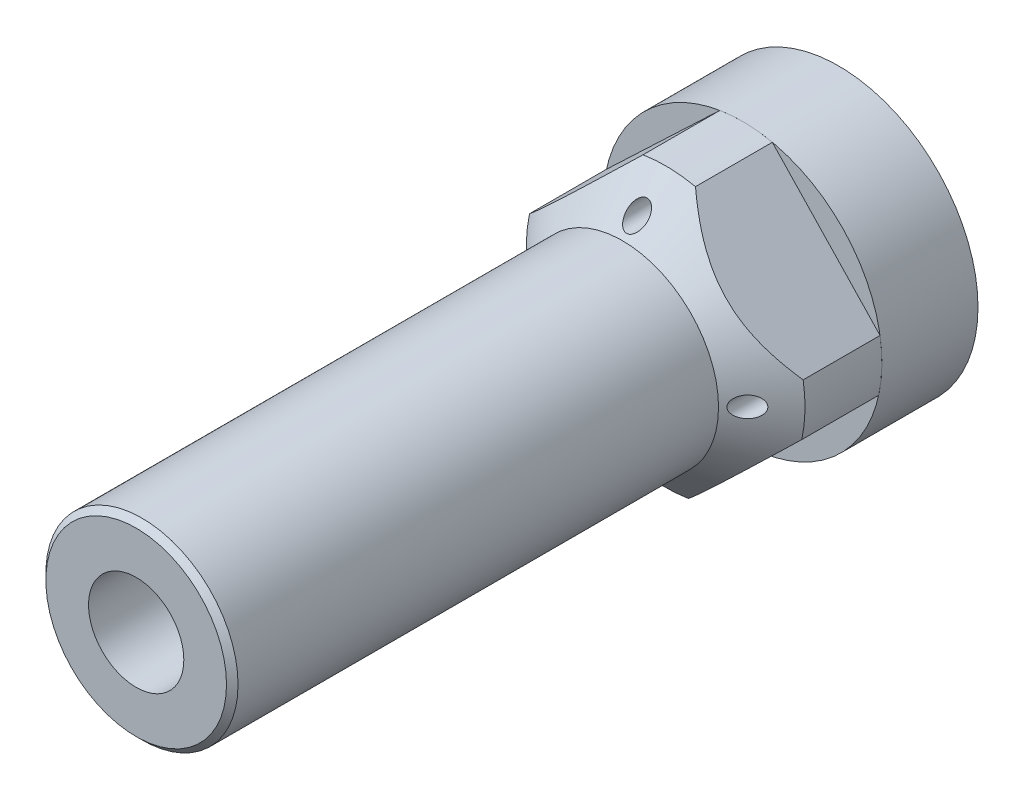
ISO-10303-21;
HEADER;
FILE_DESCRIPTION(('STEP AP214'),'2;1');
FILE_NAME('part.step','',(''),(''),'','','');
FILE_SCHEMA(('AUTOMOTIVE_DESIGN { 1 0 10303 214 1 1 1 1 }'));
ENDSEC;
DATA;
#1=APPLICATION_CONTEXT('core data for automotive mechanical design processes');
#2=APPLICATION_PROTOCOL_DEFINITION('international standard','automotive_design',2000,#1);
#3=PRODUCT_CONTEXT('',#1,'mechanical');
#4=PRODUCT('Part','Part','',(#3));
#5=PRODUCT_RELATED_PRODUCT_CATEGORY('part','',(#4));
#6=PRODUCT_DEFINITION_FORMATION('','',#4);
#7=PRODUCT_DEFINITION_CONTEXT('part definition',#1,'design');
#8=PRODUCT_DEFINITION('design','',#6,#7);
#9=PRODUCT_DEFINITION_SHAPE('','',#8);
#10=(LENGTH_UNIT() NAMED_UNIT(*) SI_UNIT(.MILLI.,.METRE.));
#11=(NAMED_UNIT(*) PLANE_ANGLE_UNIT() SI_UNIT($,.RADIAN.));
#12=(NAMED_UNIT(*) SI_UNIT($,.STERADIAN.) SOLID_ANGLE_UNIT());
#13=UNCERTAINTY_MEASURE_WITH_UNIT(LENGTH_MEASURE(1.E-05),#10,'distance_accuracy_value','');
#14=(GEOMETRIC_REPRESENTATION_CONTEXT(3) GLOBAL_UNCERTAINTY_ASSIGNED_CONTEXT((#13)) GLOBAL_UNIT_ASSIGNED_CONTEXT((#10,
#11,#12)) REPRESENTATION_CONTEXT('',''));
#15=CARTESIAN_POINT('',(0.,0.,0.));
#16=DIRECTION('',(0.,0.,1.));
#17=DIRECTION('',(1.,0.,0.));
#18=AXIS2_PLACEMENT_3D('',#15,#16,#17);
#19=CARTESIAN_POINT('',(0.,0.,0.));
#20=DIRECTION('',(0.,0.,1.));
#21=DIRECTION('',(1.,0.,0.));
#22=AXIS2_PLACEMENT_3D('',#19,#20,#21);
#23=CYLINDRICAL_SURFACE('',#22,6.35);
#24=CARTESIAN_POINT('',(0.,0.,-80.137));
#25=DIRECTION('',(0.,0.,1.));
#26=DIRECTION('',(1.,0.,0.));
#27=AXIS2_PLACEMENT_3D('',#24,#25,#26);
#28=CIRCLE('',#27,6.35);
#29=CARTESIAN_POINT('',(6.35,0.,-80.137));
#30=VERTEX_POINT('',#29);
#31=EDGE_CURVE('E114',#30,#30,#28,.T.);
#32=ORIENTED_EDGE('',*,*,#31,.T.);
#33=EDGE_LOOP('',(#32));
#34=FACE_BOUND('',#33,.T.);
#35=CARTESIAN_POINT('',(0.,0.,-76.962));
#36=DIRECTION('',(0.,0.,1.));
#37=DIRECTION('',(1.,0.,0.));
#38=AXIS2_PLACEMENT_3D('',#35,#36,#37);
#39=CIRCLE('',#38,6.35);
#40=CARTESIAN_POINT('',(6.35,0.,-76.962));
#41=VERTEX_POINT('',#40);
#42=EDGE_CURVE('E104',#41,#41,#39,.T.);
#43=ORIENTED_EDGE('',*,*,#42,.F.);
#44=EDGE_LOOP('',(#43));
#45=FACE_BOUND('',#44,.T.);
#46=ADVANCED_FACE('F59',(#34,#45),#23,.T.);
#47=CARTESIAN_POINT('',(0.,0.,-92.837));
#48=DIRECTION('',(0.,0.,1.));
#49=DIRECTION('',(1.,0.,0.));
#50=AXIS2_PLACEMENT_3D('',#47,#48,#49);
#51=PLANE('',#50);
#52=CARTESIAN_POINT('',(-14.605,1.52979254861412E-13,-92.837));
#53=DIRECTION('',(0.,0.,-1.));
#54=DIRECTION('',(-1.,0.,0.));
#55=AXIS2_PLACEMENT_3D('',#52,#53,#54);
#56=CIRCLE('',#55,1.89865);
#57=CARTESIAN_POINT('',(-16.50365,1.52979254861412E-13,-92.837));
#58=VERTEX_POINT('',#57);
#59=EDGE_CURVE('E96',#58,#58,#56,.T.);
#60=ORIENTED_EDGE('',*,*,#59,.F.);
#61=EDGE_LOOP('',(#60));
#62=FACE_BOUND('',#61,.T.);
#63=CARTESIAN_POINT('',(0.,-14.605,-92.837));
#64=DIRECTION('',(0.,0.,-1.));
#65=DIRECTION('',(-1.,0.,0.));
#66=AXIS2_PLACEMENT_3D('',#63,#64,#65);
#67=CIRCLE('',#66,1.89865);
#68=CARTESIAN_POINT('',(-1.89865,-14.605,-92.837));
#69=VERTEX_POINT('',#68);
#70=EDGE_CURVE('E86',#69,#69,#67,.T.);
#71=ORIENTED_EDGE('',*,*,#70,.F.);
#72=EDGE_LOOP('',(#71));
#73=FACE_BOUND('',#72,.T.);
#74=CARTESIAN_POINT('',(14.605,0.,-92.837));
#75=DIRECTION('',(0.,0.,-1.));
#76=DIRECTION('',(-1.,0.,0.));
#77=AXIS2_PLACEMENT_3D('',#74,#75,#76);
#78=CIRCLE('',#77,1.89865);
#79=CARTESIAN_POINT('',(12.70635,0.,-92.837));
#80=VERTEX_POINT('',#79);
#81=EDGE_CURVE('E83',#80,#80,#78,.T.);
#82=ORIENTED_EDGE('',*,*,#81,.F.);
#83=EDGE_LOOP('',(#82));
#84=FACE_BOUND('',#83,.T.);
#85=CARTESIAN_POINT('',(0.,14.605,-92.837));
#86=DIRECTION('',(0.,0.,-1.));
#87=DIRECTION('',(-1.,0.,0.));
#88=AXIS2_PLACEMENT_3D('',#85,#86,#87);
#89=CIRCLE('',#88,1.89865);
#90=CARTESIAN_POINT('',(-1.89865,14.605,-92.837));
#91=VERTEX_POINT('',#90);
#92=EDGE_CURVE('E80',#91,#91,#89,.T.);
#93=ORIENTED_EDGE('',*,*,#92,.F.);
#94=EDGE_LOOP('',(#93));
#95=FACE_BOUND('',#94,.T.);
#96=CARTESIAN_POINT('',(0.,0.,-92.837));
#97=DIRECTION('',(0.,0.,1.));
#98=DIRECTION('',(1.,0.,0.));
#99=AXIS2_PLACEMENT_3D('',#96,#97,#98);
#100=CIRCLE('',#99,18.415);
#101=CARTESIAN_POINT('',(18.415,0.,-92.837));
#102=VERTEX_POINT('',#101);
#103=EDGE_CURVE('E67',#102,#102,#100,.T.);
#104=ORIENTED_EDGE('',*,*,#103,.F.);
#105=EDGE_LOOP('',(#104));
#106=FACE_BOUND('',#105,.T.);
#107=ADVANCED_FACE('F134',(#62,#73,#84,#95,#106),#51,.F.);
#108=CARTESIAN_POINT('',(0.,0.,0.));
#109=DIRECTION('',(0.,0.,1.));
#110=DIRECTION('',(1.,0.,0.));
#111=AXIS2_PLACEMENT_3D('',#108,#109,#110);
#112=CYLINDRICAL_SURFACE('',#111,18.415);
#113=CARTESIAN_POINT('',(0.,0.,-80.137));
#114=DIRECTION('',(0.,0.,1.));
#115=DIRECTION('',(1.,0.,0.));
#116=AXIS2_PLACEMENT_3D('',#113,#114,#115);
#117=CIRCLE('',#116,18.415);
#118=CARTESIAN_POINT('',(18.415,0.,-80.137));
#119=VERTEX_POINT('',#118);
#120=EDGE_CURVE('E72',#119,#119,#117,.T.);
#121=ORIENTED_EDGE('',*,*,#120,.F.);
#122=EDGE_LOOP('',(#121));
#123=FACE_BOUND('',#122,.T.);
#124=ORIENTED_EDGE('',*,*,#103,.T.);
#125=EDGE_LOOP('',(#124));
#126=FACE_BOUND('',#125,.T.);
#127=ADVANCED_FACE('F131',(#123,#126),#112,.T.);
#128=CARTESIAN_POINT('',(0.,18.415,-80.137));
#129=DIRECTION('',(0.,0.,-1.));
#130=DIRECTION('',(-1.,0.,0.));
#131=AXIS2_PLACEMENT_3D('',#128,#129,#130);
#132=PLANE('',#131);
#133=CARTESIAN_POINT('',(-14.605,1.52979254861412E-13,-80.137));
#134=DIRECTION('',(0.,0.,-1.));
#135=DIRECTION('',(-1.,0.,0.));
#136=AXIS2_PLACEMENT_3D('',#133,#134,#135);
#137=CIRCLE('',#136,1.89865);
#138=CARTESIAN_POINT('',(-16.50365,1.52979254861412E-13,-80.137));
#139=VERTEX_POINT('',#138);
#140=EDGE_CURVE('E63',#139,#139,#137,.T.);
#141=ORIENTED_EDGE('',*,*,#140,.T.);
#142=EDGE_LOOP('',(#141));
#143=FACE_BOUND('',#142,.T.);
#144=CARTESIAN_POINT('',(0.,-14.605,-80.137));
#145=DIRECTION('',(0.,0.,-1.));
#146=DIRECTION('',(-1.,0.,0.));
#147=AXIS2_PLACEMENT_3D('',#144,#145,#146);
#148=CIRCLE('',#147,1.89865);
#149=CARTESIAN_POINT('',(-1.89865,-14.605,-80.137));
#150=VERTEX_POINT('',#149);
#151=EDGE_CURVE('E84',#150,#150,#148,.T.);
#152=ORIENTED_EDGE('',*,*,#151,.T.);
#153=EDGE_LOOP('',(#152));
#154=FACE_BOUND('',#153,.T.);
#155=CARTESIAN_POINT('',(14.605,0.,-80.137));
#156=DIRECTION('',(0.,0.,-1.));
#157=DIRECTION('',(-1.,0.,0.));
#158=AXIS2_PLACEMENT_3D('',#155,#156,#157);
#159=CIRCLE('',#158,1.89865);
#160=CARTESIAN_POINT('',(12.70635,0.,-80.137));
#161=VERTEX_POINT('',#160);
#162=EDGE_CURVE('E81',#161,#161,#159,.T.);
#163=ORIENTED_EDGE('',*,*,#162,.T.);
#164=EDGE_LOOP('',(#163));
#165=FACE_BOUND('',#164,.T.);
#166=CARTESIAN_POINT('',(0.,14.605,-80.137));
#167=DIRECTION('',(0.,0.,-1.));
#168=DIRECTION('',(-1.,0.,0.));
#169=AXIS2_PLACEMENT_3D('',#166,#167,#168);
#170=CIRCLE('',#169,1.89865);
#171=CARTESIAN_POINT('',(-1.89865,14.605,-80.137));
#172=VERTEX_POINT('',#171);
#173=EDGE_CURVE('E76',#172,#172,#170,.T.);
#174=ORIENTED_EDGE('',*,*,#173,.T.);
#175=EDGE_LOOP('',(#174));
#176=FACE_BOUND('',#175,.T.);
#177=ORIENTED_EDGE('',*,*,#31,.F.);
#178=EDGE_LOOP('',(#177));
#179=FACE_BOUND('',#178,.T.);
#180=ORIENTED_EDGE('',*,*,#120,.T.);
#181=EDGE_LOOP('',(#180));
#182=FACE_BOUND('',#181,.T.);
#183=ADVANCED_FACE('F129',(#143,#154,#165,#176,#179,#182),#132,.F.);
#184=CARTESIAN_POINT('',(0.,6.35,-73.406));
#185=DIRECTION('',(0.,0.,-1.));
#186=DIRECTION('',(-1.,0.,0.));
#187=AXIS2_PLACEMENT_3D('',#184,#185,#186);
#188=PLANE('',#187);
#189=CARTESIAN_POINT('',(0.,0.,-73.406));
#190=DIRECTION('',(0.,0.,1.));
#191=DIRECTION('',(1.,0.,0.));
#192=AXIS2_PLACEMENT_3D('',#189,#190,#191);
#193=CIRCLE('',#192,4.445);
#194=CARTESIAN_POINT('',(4.445,0.,-73.406));
#195=VERTEX_POINT('',#194);
#196=EDGE_CURVE('E111',#195,#195,#193,.T.);
#197=ORIENTED_EDGE('',*,*,#196,.T.);
#198=EDGE_LOOP('',(#197));
#199=FACE_BOUND('',#198,.T.);
#200=CARTESIAN_POINT('',(0.,0.,-73.406));
#201=DIRECTION('',(0.,0.,1.));
#202=DIRECTION('',(1.,0.,0.));
#203=AXIS2_PLACEMENT_3D('',#200,#201,#202);
#204=CIRCLE('',#203,6.35);
#205=CARTESIAN_POINT('',(6.35,0.,-73.406));
#206=VERTEX_POINT('',#205);
#207=EDGE_CURVE('E101',#206,#206,#204,.T.);
#208=ORIENTED_EDGE('',*,*,#207,.F.);
#209=EDGE_LOOP('',(#208));
#210=FACE_BOUND('',#209,.T.);
#211=ADVANCED_FACE('F171',(#199,#210),#188,.T.);
#212=CARTESIAN_POINT('',(0.,0.,0.));
#213=DIRECTION('',(0.,0.,1.));
#214=DIRECTION('',(1.,0.,0.));
#215=AXIS2_PLACEMENT_3D('',#212,#213,#214);
#216=CYLINDRICAL_SURFACE('',#215,4.445);
#217=CARTESIAN_POINT('',(0.,0.,-76.962));
#218=DIRECTION('',(0.,0.,1.));
#219=DIRECTION('',(1.,0.,0.));
#220=AXIS2_PLACEMENT_3D('',#217,#218,#219);
#221=CIRCLE('',#220,4.445);
#222=CARTESIAN_POINT('',(4.445,0.,-76.962));
#223=VERTEX_POINT('',#222);
#224=EDGE_CURVE('E108',#223,#223,#221,.T.);
#225=ORIENTED_EDGE('',*,*,#224,.T.);
#226=EDGE_LOOP('',(#225));
#227=FACE_BOUND('',#226,.T.);
#228=ORIENTED_EDGE('',*,*,#196,.F.);
#229=EDGE_LOOP('',(#228));
#230=FACE_BOUND('',#229,.T.);
#231=ADVANCED_FACE('F181',(#227,#230),#216,.T.);
#232=CARTESIAN_POINT('',(0.,4.445,-76.962));
#233=DIRECTION('',(0.,0.,1.));
#234=DIRECTION('',(1.,0.,0.));
#235=AXIS2_PLACEMENT_3D('',#232,#233,#234);
#236=PLANE('',#235);
#237=ORIENTED_EDGE('',*,*,#42,.T.);
#238=EDGE_LOOP('',(#237));
#239=FACE_BOUND('',#238,.T.);
#240=ORIENTED_EDGE('',*,*,#224,.F.);
#241=EDGE_LOOP('',(#240));
#242=FACE_BOUND('',#241,.T.);
#243=ADVANCED_FACE('F193',(#239,#242),#236,.T.);
#244=CARTESIAN_POINT('',(0.,0.,-70.231));
#245=DIRECTION('',(0.,0.,1.));
#246=DIRECTION('',(1.,0.,0.));
#247=AXIS2_PLACEMENT_3D('',#244,#245,#246);
#248=CIRCLE('',#247,6.35);
#249=CARTESIAN_POINT('',(6.35,0.,-70.231));
#250=VERTEX_POINT('',#249);
#251=EDGE_CURVE('E117',#250,#250,#248,.T.);
#252=ORIENTED_EDGE('',*,*,#251,.F.);
#253=EDGE_LOOP('',(#252));
#254=FACE_BOUND('',#253,.T.);
#255=ORIENTED_EDGE('',*,*,#207,.T.);
#256=EDGE_LOOP('',(#255));
#257=FACE_BOUND('',#256,.T.);
#258=ADVANCED_FACE('F61',(#254,#257),#23,.T.);
#259=CARTESIAN_POINT('',(0.,6.35,-66.675));
#260=DIRECTION('',(0.,0.,-1.));
#261=DIRECTION('',(-1.,0.,0.));
#262=AXIS2_PLACEMENT_3D('',#259,#260,#261);
#263=PLANE('',#262);
#264=CARTESIAN_POINT('',(0.,0.,-66.675));
#265=DIRECTION('',(0.,0.,1.));
#266=DIRECTION('',(1.,0.,0.));
#267=AXIS2_PLACEMENT_3D('',#264,#265,#266);
#268=CIRCLE('',#267,4.445);
#269=CARTESIAN_POINT('',(4.445,0.,-66.675));
#270=VERTEX_POINT('',#269);
#271=EDGE_CURVE('E105',#270,#270,#268,.T.);
#272=ORIENTED_EDGE('',*,*,#271,.T.);
#273=EDGE_LOOP('',(#272));
#274=FACE_BOUND('',#273,.T.);
#275=CARTESIAN_POINT('',(0.,0.,-66.675));
#276=DIRECTION('',(0.,0.,1.));
#277=DIRECTION('',(1.,0.,0.));
#278=AXIS2_PLACEMENT_3D('',#275,#276,#277);
#279=CIRCLE('',#278,6.35);
#280=CARTESIAN_POINT('',(6.35,0.,-66.675));
#281=VERTEX_POINT('',#280);
#282=EDGE_CURVE('E79',#281,#281,#279,.T.);
#283=ORIENTED_EDGE('',*,*,#282,.F.);
#284=EDGE_LOOP('',(#283));
#285=FACE_BOUND('',#284,.T.);
#286=ADVANCED_FACE('F166',(#274,#285),#263,.T.);
#287=CARTESIAN_POINT('',(0.,0.,0.));
#288=DIRECTION('',(0.,0.,1.));
#289=DIRECTION('',(1.,0.,0.));
#290=AXIS2_PLACEMENT_3D('',#287,#288,#289);
#291=CYLINDRICAL_SURFACE('',#290,4.445);
#292=CARTESIAN_POINT('',(0.,0.,-70.231));
#293=DIRECTION('',(0.,0.,1.));
#294=DIRECTION('',(1.,0.,0.));
#295=AXIS2_PLACEMENT_3D('',#292,#293,#294);
#296=CIRCLE('',#295,4.445);
#297=CARTESIAN_POINT('',(4.445,0.,-70.231));
#298=VERTEX_POINT('',#297);
#299=EDGE_CURVE('E120',#298,#298,#296,.T.);
#300=ORIENTED_EDGE('',*,*,#299,.T.);
#301=EDGE_LOOP('',(#300));
#302=FACE_BOUND('',#301,.T.);
#303=ORIENTED_EDGE('',*,*,#271,.F.);
#304=EDGE_LOOP('',(#303));
#305=FACE_BOUND('',#304,.T.);
#306=ADVANCED_FACE('F160',(#302,#305),#291,.T.);
#307=CARTESIAN_POINT('',(0.,4.445,-70.231));
#308=DIRECTION('',(0.,0.,1.));
#309=DIRECTION('',(1.,0.,0.));
#310=AXIS2_PLACEMENT_3D('',#307,#308,#309);
#311=PLANE('',#310);
#312=ORIENTED_EDGE('',*,*,#251,.T.);
#313=EDGE_LOOP('',(#312));
#314=FACE_BOUND('',#313,.T.);
#315=ORIENTED_EDGE('',*,*,#299,.F.);
#316=EDGE_LOOP('',(#315));
#317=FACE_BOUND('',#316,.T.);
#318=ADVANCED_FACE('F153',(#314,#317),#311,.T.);
#319=CARTESIAN_POINT('',(0.,6.35,-63.5));
#320=DIRECTION('',(0.,0.,-1.));
#321=DIRECTION('',(-1.,0.,0.));
#322=AXIS2_PLACEMENT_3D('',#319,#320,#321);
#323=PLANE('',#322);
#324=CARTESIAN_POINT('',(0.,0.,-63.5));
#325=DIRECTION('',(0.,0.,1.));
#326=DIRECTION('',(1.,0.,0.));
#327=AXIS2_PLACEMENT_3D('',#324,#325,#326);
#328=CIRCLE('',#327,6.35);
#329=CARTESIAN_POINT('',(6.35,0.,-63.5));
#330=VERTEX_POINT('',#329);
#331=EDGE_CURVE('E11',#330,#330,#328,.T.);
#332=ORIENTED_EDGE('',*,*,#331,.T.);
#333=EDGE_LOOP('',(#332));
#334=FACE_BOUND('',#333,.T.);
#335=ADVANCED_FACE('F151',(#334),#323,.F.);
#336=ORIENTED_EDGE('',*,*,#331,.F.);
#337=EDGE_LOOP('',(#336));
#338=FACE_BOUND('',#337,.T.);
#339=ORIENTED_EDGE('',*,*,#282,.T.);
#340=EDGE_LOOP('',(#339));
#341=FACE_BOUND('',#340,.T.);
#342=ADVANCED_FACE('F147',(#338,#341),#23,.T.);
#343=CARTESIAN_POINT('',(0.,14.605,-92.837));
#344=DIRECTION('',(0.,0.,-1.));
#345=DIRECTION('',(-1.,0.,0.));
#346=AXIS2_PLACEMENT_3D('',#343,#344,#345);
#347=CYLINDRICAL_SURFACE('',#346,1.89865);
#348=ORIENTED_EDGE('',*,*,#92,.T.);
#349=EDGE_LOOP('',(#348));
#350=FACE_BOUND('',#349,.T.);
#351=ORIENTED_EDGE('',*,*,#173,.F.);
#352=EDGE_LOOP('',(#351));
#353=FACE_BOUND('',#352,.T.);
#354=ADVANCED_FACE('F157',(#350,#353),#347,.F.);
#355=CARTESIAN_POINT('',(14.605,0.,-92.837));
#356=DIRECTION('',(0.,0.,-1.));
#357=DIRECTION('',(-1.,0.,0.));
#358=AXIS2_PLACEMENT_3D('',#355,#356,#357);
#359=CYLINDRICAL_SURFACE('',#358,1.89865);
#360=ORIENTED_EDGE('',*,*,#81,.T.);
#361=EDGE_LOOP('',(#360));
#362=FACE_BOUND('',#361,.T.);
#363=ORIENTED_EDGE('',*,*,#162,.F.);
#364=EDGE_LOOP('',(#363));
#365=FACE_BOUND('',#364,.T.);
#366=ADVANCED_FACE('F237',(#362,#365),#359,.F.);
#367=CARTESIAN_POINT('',(0.,-14.605,-92.837));
#368=DIRECTION('',(0.,0.,-1.));
#369=DIRECTION('',(-1.,0.,0.));
#370=AXIS2_PLACEMENT_3D('',#367,#368,#369);
#371=CYLINDRICAL_SURFACE('',#370,1.89865);
#372=ORIENTED_EDGE('',*,*,#70,.T.);
#373=EDGE_LOOP('',(#372));
#374=FACE_BOUND('',#373,.T.);
#375=ORIENTED_EDGE('',*,*,#151,.F.);
#376=EDGE_LOOP('',(#375));
#377=FACE_BOUND('',#376,.T.);
#378=ADVANCED_FACE('F246',(#374,#377),#371,.F.);
#379=CARTESIAN_POINT('',(-14.605,1.52979254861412E-13,-92.837));
#380=DIRECTION('',(0.,0.,-1.));
#381=DIRECTION('',(-1.,0.,0.));
#382=AXIS2_PLACEMENT_3D('',#379,#380,#381);
#383=CYLINDRICAL_SURFACE('',#382,1.89865);
#384=ORIENTED_EDGE('',*,*,#59,.T.);
#385=EDGE_LOOP('',(#384));
#386=FACE_BOUND('',#385,.T.);
#387=ORIENTED_EDGE('',*,*,#140,.F.);
#388=EDGE_LOOP('',(#387));
#389=FACE_BOUND('',#388,.T.);
#390=ADVANCED_FACE('F256',(#386,#389),#383,.F.);
#391=CLOSED_SHELL('',(#46,#107,#127,#183,#211,#231,#243,#258,#286,#306,#318,#335,#342,#354,#366,
#378,#390));
#392=MANIFOLD_SOLID_BREP('B2',#391);
#393=CARTESIAN_POINT('',(0.,0.,0.));
#394=DIRECTION('',(0.,0.,1.));
#395=DIRECTION('',(1.,0.,0.));
#396=AXIS2_PLACEMENT_3D('',#393,#394,#395);
#397=CYLINDRICAL_SURFACE('',#396,18.415);
#398=DIRECTION('',(0.,0.,1.));
#399=VECTOR('',#398,1.);
#400=CARTESIAN_POINT('',(-17.9891704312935,3.93725439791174,-199.607423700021));
#401=LINE('',#400,#399);
#402=CARTESIAN_POINT('',(-17.9891704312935,3.93725439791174,-80.137));
#403=VERTEX_POINT('',#402);
#404=CARTESIAN_POINT('',(-17.9891704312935,3.93725439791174,-69.977));
#405=VERTEX_POINT('',#404);
#406=EDGE_CURVE('E353',#403,#405,#401,.T.);
#407=ORIENTED_EDGE('',*,*,#406,.F.);
#408=CARTESIAN_POINT('',(0.,0.,-80.137));
#409=DIRECTION('',(0.,0.,1.));
#410=DIRECTION('',(1.,0.,0.));
#411=AXIS2_PLACEMENT_3D('',#408,#409,#410);
#412=CIRCLE('',#411,18.415);
#413=CARTESIAN_POINT('',(-18.1699465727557,-2.99420549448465,-80.137));
#414=VERTEX_POINT('',#413);
#415=EDGE_CURVE('E538',#403,#414,#412,.T.);
#416=ORIENTED_EDGE('',*,*,#415,.T.);
#417=DIRECTION('',(0.,0.,1.));
#418=VECTOR('',#417,1.);
#419=CARTESIAN_POINT('',(-18.1699465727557,-2.99420549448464,-199.607423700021));
#420=LINE('',#419,#418);
#421=CARTESIAN_POINT('',(-18.1699465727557,-2.99420549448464,-69.977));
#422=VERTEX_POINT('',#421);
#423=EDGE_CURVE('E429',#414,#422,#420,.T.);
#424=ORIENTED_EDGE('',*,*,#423,.T.);
#425=CARTESIAN_POINT('',(0.,0.,-69.977));
#426=DIRECTION('',(0.,0.,1.));
#427=DIRECTION('',(1.,0.,0.));
#428=AXIS2_PLACEMENT_3D('',#425,#426,#427);
#429=CIRCLE('',#428,18.415);
#430=EDGE_CURVE('E410',#405,#422,#429,.T.);
#431=ORIENTED_EDGE('',*,*,#430,.F.);
#432=EDGE_LOOP('',(#407,#416,#424,#431));
#433=FACE_BOUND('',#432,.T.);
#434=ADVANCED_FACE('F332',(#433),#397,.T.);
#435=CARTESIAN_POINT('',(0.,0.,-69.977));
#436=DIRECTION('',(0.,0.,-1.));
#437=DIRECTION('',(-1.,0.,0.));
#438=AXIS2_PLACEMENT_3D('',#435,#436,#437);
#439=CONICAL_SURFACE('',#438,18.415,0.785398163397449);
#440=CARTESIAN_POINT('',(-15.8010548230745,-0.631541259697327,-67.3756706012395));
#441=CARTESIAN_POINT('',(-15.8271101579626,-0.58218961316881,-67.3997343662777));
#442=CARTESIAN_POINT('',(-15.8506236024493,-0.530246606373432,-67.4213956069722));
#443=CARTESIAN_POINT('',(-15.8913763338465,-0.421878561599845,-67.4588809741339));
#444=CARTESIAN_POINT('',(-15.9086089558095,-0.36544883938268,-67.4746989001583));
#445=CARTESIAN_POINT('',(-15.9357669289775,-0.249067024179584,-67.4996057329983));
#446=CARTESIAN_POINT('',(-15.9456544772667,-0.189098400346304,-67.5086598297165));
#447=CARTESIAN_POINT('',(-15.9572247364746,-0.0677431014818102,-67.5192532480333));
#448=CARTESIAN_POINT('',(-15.9589133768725,-0.00635748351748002,-67.5207980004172));
#449=CARTESIAN_POINT('',(-15.9541368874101,0.11171929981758,-67.5164259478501));
#450=CARTESIAN_POINT('',(-15.9482050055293,0.168451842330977,-67.5109971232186));
#451=CARTESIAN_POINT('',(-15.9294994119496,0.279788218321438,-67.4938585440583));
#452=CARTESIAN_POINT('',(-15.9167243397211,0.334391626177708,-67.4821475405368));
#453=CARTESIAN_POINT('',(-15.8848570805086,0.441026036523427,-67.4528859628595));
#454=CARTESIAN_POINT('',(-15.8656702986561,0.493004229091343,-67.4352479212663));
#455=CARTESIAN_POINT('',(-15.8220228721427,0.592630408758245,-67.3950369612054));
#456=CARTESIAN_POINT('',(-15.7975596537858,0.640276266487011,-67.3724616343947));
#457=CARTESIAN_POINT('',(-15.7324463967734,0.75101247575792,-67.312218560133));
#458=CARTESIAN_POINT('',(-15.6894442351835,0.811508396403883,-67.272311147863));
#459=CARTESIAN_POINT('',(-15.5970267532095,0.922225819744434,-67.1861603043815));
#460=CARTESIAN_POINT('',(-15.5475980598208,0.972425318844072,-67.1399036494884));
#461=CARTESIAN_POINT('',(-15.4263641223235,1.07856785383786,-67.0258844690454));
#462=CARTESIAN_POINT('',(-15.3527590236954,1.13042743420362,-66.9562408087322));
#463=CARTESIAN_POINT('',(-15.2010613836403,1.21727628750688,-66.8116436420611));
#464=CARTESIAN_POINT('',(-15.1229631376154,1.25224355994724,-66.7366833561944));
#465=CARTESIAN_POINT('',(-14.9427407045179,1.31405150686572,-66.5623446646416));
#466=CARTESIAN_POINT('',(-14.8399316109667,1.33598982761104,-66.4619344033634));
#467=CARTESIAN_POINT('',(-14.6341537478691,1.35618865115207,-66.2588480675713));
#468=CARTESIAN_POINT('',(-14.5311849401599,1.35441933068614,-66.1561693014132));
#469=CARTESIAN_POINT('',(-14.3268880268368,1.32769073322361,-65.9502752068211));
#470=CARTESIAN_POINT('',(-14.2255841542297,1.3025154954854,-65.847063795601));
#471=CARTESIAN_POINT('',(-14.0285133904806,1.22806082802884,-65.6441328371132));
#472=CARTESIAN_POINT('',(-13.932736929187,1.17882454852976,-65.5444073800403));
#473=CARTESIAN_POINT('',(-13.7827268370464,1.07626848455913,-65.3866412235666));
#474=CARTESIAN_POINT('',(-13.7257408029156,1.0304920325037,-65.3262878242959));
#475=CARTESIAN_POINT('',(-13.6173767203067,0.927138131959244,-65.2108183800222));
#476=CARTESIAN_POINT('',(-13.565990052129,0.869579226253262,-65.1556943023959));
#477=CARTESIAN_POINT('',(-13.4834466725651,0.758287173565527,-65.06667689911));
#478=CARTESIAN_POINT('',(-13.4504821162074,0.707360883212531,-65.0309649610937));
#479=CARTESIAN_POINT('',(-13.3904811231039,0.598484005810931,-64.9657449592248));
#480=CARTESIAN_POINT('',(-13.3634362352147,0.540543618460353,-64.9362280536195));
#481=CARTESIAN_POINT('',(-13.3217644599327,0.430604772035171,-64.8906353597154));
#482=CARTESIAN_POINT('',(-13.3057324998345,0.379772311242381,-64.8730486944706));
#483=CARTESIAN_POINT('',(-13.2795715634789,0.274855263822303,-64.8443138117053));
#484=CARTESIAN_POINT('',(-13.2694378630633,0.220773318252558,-64.8331604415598));
#485=CARTESIAN_POINT('',(-13.2558166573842,0.110448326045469,-64.8181619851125));
#486=CARTESIAN_POINT('',(-13.2523659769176,0.0541950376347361,-64.8143573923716));
#487=CARTESIAN_POINT('',(-13.2525371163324,-0.0582859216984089,-64.8145460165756));
#488=CARTESIAN_POINT('',(-13.2561582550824,-0.11451359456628,-64.8185384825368));
#489=CARTESIAN_POINT('',(-13.2695445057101,-0.220352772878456,-64.8332775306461));
#490=CARTESIAN_POINT('',(-13.2787633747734,-0.270121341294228,-64.8434235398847));
#491=CARTESIAN_POINT('',(-13.30222637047,-0.366958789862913,-64.8691997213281));
#492=CARTESIAN_POINT('',(-13.3164725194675,-0.414026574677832,-64.8848321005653));
#493=CARTESIAN_POINT('',(-13.3554896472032,-0.522064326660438,-64.9275462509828));
#494=CARTESIAN_POINT('',(-13.3822026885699,-0.581504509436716,-64.9567211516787));
#495=CARTESIAN_POINT('',(-13.4418774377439,-0.69323171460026,-65.0216309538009));
#496=CARTESIAN_POINT('',(-13.4748521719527,-0.745503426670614,-65.057379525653));
#497=CARTESIAN_POINT('',(-13.560082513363,-0.862997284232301,-65.1493563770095));
#498=CARTESIAN_POINT('',(-13.6146788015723,-0.924660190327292,-65.2079476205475));
#499=CARTESIAN_POINT('',(-13.7301945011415,-1.03464286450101,-65.3310293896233));
#500=CARTESIAN_POINT('',(-13.7911250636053,-1.08293853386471,-65.3955302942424));
#501=CARTESIAN_POINT('',(-13.9410803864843,-1.18300570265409,-65.5530901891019));
#502=CARTESIAN_POINT('',(-14.0320650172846,-1.22927587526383,-65.6477800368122));
#503=CARTESIAN_POINT('',(-14.2189783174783,-1.30014463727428,-65.8402714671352));
#504=CARTESIAN_POINT('',(-14.3149119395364,-1.32472105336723,-65.9380761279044));
#505=CARTESIAN_POINT('',(-14.5109800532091,-1.35297008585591,-66.1359166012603));
#506=CARTESIAN_POINT('',(-14.6111585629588,-1.35627234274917,-66.2359616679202));
#507=CARTESIAN_POINT('',(-14.8116073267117,-1.34044727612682,-66.4341285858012));
#508=CARTESIAN_POINT('',(-14.9118774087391,-1.32134081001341,-66.5322521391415));
#509=CARTESIAN_POINT('',(-15.090115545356,-1.26530259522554,-66.7050378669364));
#510=CARTESIAN_POINT('',(-15.1686058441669,-1.23259409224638,-66.78053162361));
#511=CARTESIAN_POINT('',(-15.3215184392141,-1.15043923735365,-66.9265768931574));
#512=CARTESIAN_POINT('',(-15.395943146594,-1.10100293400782,-66.9971313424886));
#513=CARTESIAN_POINT('',(-15.5202114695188,-0.998305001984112,-67.114212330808));
#514=CARTESIAN_POINT('',(-15.5716399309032,-0.948876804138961,-67.1624170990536));
#515=CARTESIAN_POINT('',(-15.6680872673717,-0.839355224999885,-67.2524494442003));
#516=CARTESIAN_POINT('',(-15.7131319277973,-0.7793070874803,-67.2943027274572));
#517=CARTESIAN_POINT('',(-15.7702502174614,-0.687439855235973,-67.3472024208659));
#518=CARTESIAN_POINT('',(-15.7860727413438,-0.659918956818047,-67.3618336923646));
#519=CARTESIAN_POINT('',(-15.8010548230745,-0.631541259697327,-67.3756706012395));
#520=B_SPLINE_CURVE_WITH_KNOTS('',3,(#440,#441,#442,#443,#444,#445,#446,#447,#448,#449,#450,
#451,#452,#453,#454,#455,#456,#457,#458,#459,#460,#461,#462,#463,#464,#465,#466,#467,#468,#469,
#470,#471,#472,#473,#474,#475,#476,#477,#478,#479,#480,#481,#482,#483,#484,#485,#486,#487,#488,
#489,#490,#491,#492,#493,#494,#495,#496,#497,#498,#499,#500,#501,#502,#503,#504,#505,#506,#507,
#508,#509,#510,#511,#512,#513,#514,#515,#516,#517,#518,#519),.UNSPECIFIED.,.T.,.F.,(4,2,2,2,2,2,
2,2,2,2,2,2,2,2,2,2,2,2,2,2,2,2,2,2,2,2,2,2,2,2,2,2,2,2,2,2,2,2,2,4),(0.,0.182237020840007,
0.364666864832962,0.548029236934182,0.731258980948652,0.902338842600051,1.07345273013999,
1.24721162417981,1.42105546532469,1.67246675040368,1.92440983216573,2.26405366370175,
2.60413866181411,3.03803436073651,3.47247593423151,3.91096620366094,4.34867297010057,
4.63224633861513,4.9153768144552,5.12587073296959,5.33606215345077,5.50377002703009,
5.67134339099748,5.83983752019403,6.00831542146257,6.16252648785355,6.31679966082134,
6.52980951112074,6.74326744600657,7.04482581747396,7.34692435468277,7.76243140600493,
8.17836265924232,8.60151568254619,9.02427515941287,9.36424900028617,9.70401897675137,
9.96141152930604,10.217732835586,10.322520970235),.UNSPECIFIED.);
#521=CARTESIAN_POINT('',(-15.8010548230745,-0.631541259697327,-67.3756706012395));
#522=VERTEX_POINT('',#521);
#523=EDGE_CURVE('E452',#522,#522,#520,.T.);
#524=ORIENTED_EDGE('',*,*,#523,.T.);
#525=EDGE_LOOP('',(#524));
#526=FACE_BOUND('',#525,.T.);
#527=CARTESIAN_POINT('',(-0.63154125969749,-15.8010548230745,-67.3756706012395));
#528=CARTESIAN_POINT('',(-0.702589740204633,-15.7635367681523,-67.3410197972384));
#529=CARTESIAN_POINT('',(-0.768381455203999,-15.7206806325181,-67.3013240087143));
#530=CARTESIAN_POINT('',(-0.888780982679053,-15.6273976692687,-67.214525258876));
#531=CARTESIAN_POINT('',(-0.943358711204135,-15.5769510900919,-67.1674029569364));
#532=CARTESIAN_POINT('',(-1.05460507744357,-15.456802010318,-67.0545951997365));
#533=CARTESIAN_POINT('',(-1.10795887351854,-15.3855494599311,-66.9873083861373));
#534=CARTESIAN_POINT('',(-1.19823458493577,-15.238323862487,-66.8472784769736));
#535=CARTESIAN_POINT('',(-1.23514122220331,-15.162346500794,-66.7745303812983));
#536=CARTESIAN_POINT('',(-1.30214443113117,-14.9858990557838,-66.6042941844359));
#537=CARTESIAN_POINT('',(-1.32728049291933,-14.8846346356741,-66.5056773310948));
#538=CARTESIAN_POINT('',(-1.35427037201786,-14.681526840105,-66.3058388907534));
#539=CARTESIAN_POINT('',(-1.35609500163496,-14.579682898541,-66.2046141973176));
#540=CARTESIAN_POINT('',(-1.33712022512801,-14.3770207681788,-66.0010655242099));
#541=CARTESIAN_POINT('',(-1.31607569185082,-14.2762256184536,-65.8987415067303));
#542=CARTESIAN_POINT('',(-1.25059838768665,-14.0795202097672,-65.6969310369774));
#543=CARTESIAN_POINT('',(-1.20619788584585,-13.9836034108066,-65.5974408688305));
#544=CARTESIAN_POINT('',(-1.1102161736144,-13.8289203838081,-65.4353745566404));
#545=CARTESIAN_POINT('',(-1.06523823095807,-13.7679267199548,-65.3709955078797));
#546=CARTESIAN_POINT('',(-0.962529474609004,-13.6516196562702,-65.2474287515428));
#547=CARTESIAN_POINT('',(-0.904819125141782,-13.5962973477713,-65.188232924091));
#548=CARTESIAN_POINT('',(-0.793240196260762,-13.5078390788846,-65.0930373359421));
#549=CARTESIAN_POINT('',(-0.742577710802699,-13.4727560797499,-65.0551017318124));
#550=CARTESIAN_POINT('',(-0.633804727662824,-13.4084808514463,-64.9853491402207));
#551=CARTESIAN_POINT('',(-0.575705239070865,-13.3792800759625,-64.9535232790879));
#552=CARTESIAN_POINT('',(-0.465443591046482,-13.3339679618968,-64.9040033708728));
#553=CARTESIAN_POINT('',(-0.414591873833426,-13.3163958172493,-64.8847453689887));
#554=CARTESIAN_POINT('',(-0.309271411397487,-13.2871529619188,-64.8526494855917));
#555=CARTESIAN_POINT('',(-0.254805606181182,-13.2754775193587,-64.8398064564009));
#556=CARTESIAN_POINT('',(-0.143237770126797,-13.258867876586,-64.8215243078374));
#557=CARTESIAN_POINT('',(-0.086121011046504,-13.253977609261,-64.8161334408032));
#558=CARTESIAN_POINT('',(0.0284565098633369,-13.2515370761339,-64.8134439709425));
#559=CARTESIAN_POINT('',(0.0859171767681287,-13.2539848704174,-64.8161432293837));
#560=CARTESIAN_POINT('',(0.193451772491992,-13.2653739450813,-64.8286864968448));
#561=CARTESIAN_POINT('',(0.243689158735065,-13.2736403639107,-64.8377878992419));
#562=CARTESIAN_POINT('',(0.341622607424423,-13.2953416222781,-64.8616404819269));
#563=CARTESIAN_POINT('',(0.389317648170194,-13.3087785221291,-64.8763939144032));
#564=CARTESIAN_POINT('',(0.497406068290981,-13.3455275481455,-64.9166529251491));
#565=CARTESIAN_POINT('',(0.556454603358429,-13.3706486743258,-64.9441132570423));
#566=CARTESIAN_POINT('',(0.667756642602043,-13.4271173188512,-65.0056011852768));
#567=CARTESIAN_POINT('',(0.719996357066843,-13.4584771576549,-65.0396417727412));
#568=CARTESIAN_POINT('',(0.837439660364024,-13.5396139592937,-65.1273269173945));
#569=CARTESIAN_POINT('',(0.899287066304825,-13.5916970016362,-65.1833172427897));
#570=CARTESIAN_POINT('',(1.01019714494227,-13.7022038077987,-65.3012958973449));
#571=CARTESIAN_POINT('',(1.05923606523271,-13.7606390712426,-65.3632950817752));
#572=CARTESIAN_POINT('',(1.16222875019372,-13.9055027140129,-65.5158857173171));
#573=CARTESIAN_POINT('',(1.21069350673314,-13.9939882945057,-65.6082294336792));
#574=CARTESIAN_POINT('',(1.28653853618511,-14.1761087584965,-65.7963387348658));
#575=CARTESIAN_POINT('',(1.31389792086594,-14.2697486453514,-65.8921076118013));
#576=CARTESIAN_POINT('',(1.34853407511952,-14.4616854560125,-66.0864214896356));
#577=CARTESIAN_POINT('',(1.35540439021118,-14.5600377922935,-66.184984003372));
#578=CARTESIAN_POINT('',(1.34756543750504,-14.7572940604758,-66.3806870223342));
#579=CARTESIAN_POINT('',(1.33286771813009,-14.8561976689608,-66.4778282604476));
#580=CARTESIAN_POINT('',(1.28468061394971,-15.0366292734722,-66.6533813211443));
#581=CARTESIAN_POINT('',(1.25445765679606,-15.1184739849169,-66.732362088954));
#582=CARTESIAN_POINT('',(1.17641298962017,-15.2783006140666,-66.8854575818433));
#583=CARTESIAN_POINT('',(1.12861521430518,-15.3562876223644,-66.9595787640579));
#584=CARTESIAN_POINT('',(1.02924797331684,-15.4852198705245,-67.0813206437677));
#585=CARTESIAN_POINT('',(0.982065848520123,-15.5378391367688,-67.13074502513));
#586=CARTESIAN_POINT('',(0.87695985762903,-15.6372536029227,-67.2237270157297));
#587=CARTESIAN_POINT('',(0.819051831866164,-15.6840572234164,-67.2672931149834));
#588=CARTESIAN_POINT('',(0.705921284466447,-15.7602846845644,-67.3380027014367));
#589=CARTESIAN_POINT('',(0.652725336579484,-15.7912902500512,-67.3666703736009));
#590=CARTESIAN_POINT('',(0.540125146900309,-15.8466046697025,-67.4177037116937));
#591=CARTESIAN_POINT('',(0.480723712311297,-15.8709165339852,-67.4400722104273));
#592=CARTESIAN_POINT('',(0.356300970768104,-15.911427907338,-67.4772923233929));
#593=CARTESIAN_POINT('',(0.291234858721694,-15.9275542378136,-67.4920761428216));
#594=CARTESIAN_POINT('',(0.158055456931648,-15.9499735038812,-67.5126176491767));
#595=CARTESIAN_POINT('',(0.0899453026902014,-15.9562763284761,-67.5183844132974));
#596=CARTESIAN_POINT('',(-0.0367992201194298,-15.9583184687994,-67.5202532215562));
#597=CARTESIAN_POINT('',(-0.0953995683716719,-15.9554362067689,-67.5176164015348));
#598=CARTESIAN_POINT('',(-0.211029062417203,-15.9422519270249,-67.5055435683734));
#599=CARTESIAN_POINT('',(-0.268058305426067,-15.931950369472,-67.4961079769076));
#600=CARTESIAN_POINT('',(-0.378555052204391,-15.9047314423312,-67.4711396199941));
#601=CARTESIAN_POINT('',(-0.432048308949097,-15.8878700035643,-67.4556583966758));
#602=CARTESIAN_POINT('',(-0.534980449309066,-15.8484754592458,-67.41941667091));
#603=CARTESIAN_POINT('',(-0.584417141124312,-15.8259393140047,-67.3986533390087));
#604=CARTESIAN_POINT('',(-0.63154125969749,-15.8010548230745,-67.3756706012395));
#605=B_SPLINE_CURVE_WITH_KNOTS('',3,(#527,#528,#529,#530,#531,#532,#533,#534,#535,#536,#537,
#538,#539,#540,#541,#542,#543,#544,#545,#546,#547,#548,#549,#550,#551,#552,#553,#554,#555,#556,
#557,#558,#559,#560,#561,#562,#563,#564,#565,#566,#567,#568,#569,#570,#571,#572,#573,#574,#575,
#576,#577,#578,#579,#580,#581,#582,#583,#584,#585,#586,#587,#588,#589,#590,#591,#592,#593,#594,
#595,#596,#597,#598,#599,#600,#601,#602,#603,#604),.UNSPECIFIED.,.T.,.F.,(4,2,2,2,2,2,2,2,2,2,2,
2,2,2,2,2,2,2,2,2,2,2,2,2,2,2,2,2,2,2,2,2,2,2,2,2,2,2,4),(0.,0.262223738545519,
0.525142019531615,0.8580874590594,1.19134153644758,1.61983483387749,2.04886458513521,
2.48253873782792,2.9156152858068,3.21306666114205,3.51004339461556,3.72644308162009,
3.94252605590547,4.11328906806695,4.28391483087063,4.45564029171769,4.62732035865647,
4.78180697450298,4.9363552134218,5.14459416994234,5.35324852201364,5.6466769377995,
5.94064569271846,6.34879358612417,6.75734491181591,7.17394873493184,7.5903295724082,
7.94216055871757,8.29351415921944,8.55138253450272,8.80887307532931,9.01185478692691,
9.21474506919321,9.41941858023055,9.62388591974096,9.79919079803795,9.97448480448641,
10.1483158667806,10.3222402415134),.UNSPECIFIED.);
#606=CARTESIAN_POINT('',(-0.63154125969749,-15.8010548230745,-67.3756706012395));
#607=VERTEX_POINT('',#606);
#608=EDGE_CURVE('E456',#607,#607,#605,.T.);
#609=ORIENTED_EDGE('',*,*,#608,.T.);
#610=EDGE_LOOP('',(#609));
#611=FACE_BOUND('',#610,.T.);
#612=CARTESIAN_POINT('',(15.8010548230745,-0.631541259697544,-67.3756706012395));
#613=CARTESIAN_POINT('',(15.7635367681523,-0.702589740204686,-67.3410197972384));
#614=CARTESIAN_POINT('',(15.7206806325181,-0.768381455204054,-67.3013240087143));
#615=CARTESIAN_POINT('',(15.6273976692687,-0.888780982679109,-67.214525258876));
#616=CARTESIAN_POINT('',(15.5769510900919,-0.94335871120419,-67.1674029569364));
#617=CARTESIAN_POINT('',(15.456802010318,-1.05460507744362,-67.0545951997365));
#618=CARTESIAN_POINT('',(15.3855494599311,-1.1079588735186,-66.9873083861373));
#619=CARTESIAN_POINT('',(15.238323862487,-1.19823458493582,-66.8472784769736));
#620=CARTESIAN_POINT('',(15.162346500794,-1.23514122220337,-66.7745303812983));
#621=CARTESIAN_POINT('',(14.9858990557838,-1.30214443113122,-66.6042941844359));
#622=CARTESIAN_POINT('',(14.8846346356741,-1.32728049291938,-66.5056773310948));
#623=CARTESIAN_POINT('',(14.681526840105,-1.35427037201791,-66.3058388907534));
#624=CARTESIAN_POINT('',(14.579682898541,-1.35609500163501,-66.2046141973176));
#625=CARTESIAN_POINT('',(14.3770207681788,-1.33712022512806,-66.0010655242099));
#626=CARTESIAN_POINT('',(14.2762256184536,-1.31607569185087,-65.8987415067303));
#627=CARTESIAN_POINT('',(14.0795202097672,-1.2505983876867,-65.6969310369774));
#628=CARTESIAN_POINT('',(13.9836034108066,-1.2061978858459,-65.5974408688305));
#629=CARTESIAN_POINT('',(13.8289203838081,-1.11021617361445,-65.4353745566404));
#630=CARTESIAN_POINT('',(13.7679267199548,-1.06523823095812,-65.3709955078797));
#631=CARTESIAN_POINT('',(13.6516196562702,-0.962529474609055,-65.2474287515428));
#632=CARTESIAN_POINT('',(13.5962973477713,-0.904819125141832,-65.1882329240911));
#633=CARTESIAN_POINT('',(13.5078390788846,-0.79324019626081,-65.0930373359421));
#634=CARTESIAN_POINT('',(13.4727560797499,-0.742577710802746,-65.0551017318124));
#635=CARTESIAN_POINT('',(13.4084808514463,-0.633804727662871,-64.9853491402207));
#636=CARTESIAN_POINT('',(13.3792800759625,-0.575705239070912,-64.9535232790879));
#637=CARTESIAN_POINT('',(13.3339679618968,-0.465443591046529,-64.9040033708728));
#638=CARTESIAN_POINT('',(13.3163958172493,-0.414591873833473,-64.8847453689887));
#639=CARTESIAN_POINT('',(13.2871529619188,-0.309271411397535,-64.8526494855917));
#640=CARTESIAN_POINT('',(13.2754775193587,-0.25480560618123,-64.8398064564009));
#641=CARTESIAN_POINT('',(13.258867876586,-0.143237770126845,-64.8215243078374));
#642=CARTESIAN_POINT('',(13.253977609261,-0.0861210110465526,-64.8161334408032));
#643=CARTESIAN_POINT('',(13.2515370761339,0.0284565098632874,-64.8134439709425));
#644=CARTESIAN_POINT('',(13.2539848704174,0.0859171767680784,-64.8161432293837));
#645=CARTESIAN_POINT('',(13.2653739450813,0.193451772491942,-64.8286864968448));
#646=CARTESIAN_POINT('',(13.2736403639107,0.243689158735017,-64.8377878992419));
#647=CARTESIAN_POINT('',(13.2953416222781,0.341622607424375,-64.8616404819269));
#648=CARTESIAN_POINT('',(13.3087785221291,0.389317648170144,-64.8763939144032));
#649=CARTESIAN_POINT('',(13.3455275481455,0.497406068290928,-64.9166529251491));
#650=CARTESIAN_POINT('',(13.3706486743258,0.556454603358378,-64.9441132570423));
#651=CARTESIAN_POINT('',(13.4271173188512,0.667756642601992,-65.0056011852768));
#652=CARTESIAN_POINT('',(13.4584771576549,0.719996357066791,-65.0396417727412));
#653=CARTESIAN_POINT('',(13.5396139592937,0.837439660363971,-65.1273269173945));
#654=CARTESIAN_POINT('',(13.5916970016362,0.899287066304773,-65.1833172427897));
#655=CARTESIAN_POINT('',(13.7022038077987,1.01019714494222,-65.3012958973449));
#656=CARTESIAN_POINT('',(13.7606390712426,1.05923606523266,-65.3632950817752));
#657=CARTESIAN_POINT('',(13.9055027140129,1.16222875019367,-65.515885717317));
#658=CARTESIAN_POINT('',(13.9939882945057,1.21069350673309,-65.6082294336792));
#659=CARTESIAN_POINT('',(14.1761087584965,1.28653853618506,-65.7963387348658));
#660=CARTESIAN_POINT('',(14.2697486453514,1.31389792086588,-65.8921076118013));
#661=CARTESIAN_POINT('',(14.4616854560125,1.34853407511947,-66.0864214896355));
#662=CARTESIAN_POINT('',(14.5600377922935,1.35540439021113,-66.184984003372));
#663=CARTESIAN_POINT('',(14.7572940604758,1.34756543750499,-66.3806870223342));
#664=CARTESIAN_POINT('',(14.8561976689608,1.33286771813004,-66.4778282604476));
#665=CARTESIAN_POINT('',(15.0366292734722,1.28468061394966,-66.6533813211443));
#666=CARTESIAN_POINT('',(15.1184739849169,1.25445765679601,-66.732362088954));
#667=CARTESIAN_POINT('',(15.2783006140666,1.17641298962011,-66.8854575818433));
#668=CARTESIAN_POINT('',(15.3562876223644,1.12861521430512,-66.9595787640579));
#669=CARTESIAN_POINT('',(15.4852198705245,1.02924797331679,-67.0813206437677));
#670=CARTESIAN_POINT('',(15.5378391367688,0.98206584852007,-67.13074502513));
#671=CARTESIAN_POINT('',(15.6372536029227,0.876959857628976,-67.2237270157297));
#672=CARTESIAN_POINT('',(15.6840572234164,0.81905183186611,-67.2672931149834));
#673=CARTESIAN_POINT('',(15.7602846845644,0.705921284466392,-67.3380027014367));
#674=CARTESIAN_POINT('',(15.7912902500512,0.652725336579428,-67.3666703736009));
#675=CARTESIAN_POINT('',(15.8466046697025,0.540125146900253,-67.4177037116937));
#676=CARTESIAN_POINT('',(15.8709165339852,0.480723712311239,-67.4400722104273));
#677=CARTESIAN_POINT('',(15.911427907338,0.356300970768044,-67.4772923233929));
#678=CARTESIAN_POINT('',(15.9275542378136,0.291234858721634,-67.4920761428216));
#679=CARTESIAN_POINT('',(15.9499735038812,0.158055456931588,-67.5126176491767));
#680=CARTESIAN_POINT('',(15.9562763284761,0.0899453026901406,-67.5183844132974));
#681=CARTESIAN_POINT('',(15.9583184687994,-0.0367992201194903,-67.5202532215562));
#682=CARTESIAN_POINT('',(15.9554362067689,-0.0953995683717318,-67.5176164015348));
#683=CARTESIAN_POINT('',(15.9422519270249,-0.211029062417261,-67.5055435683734));
#684=CARTESIAN_POINT('',(15.9319503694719,-0.268058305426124,-67.4961079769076));
#685=CARTESIAN_POINT('',(15.9047314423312,-0.378555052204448,-67.4711396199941));
#686=CARTESIAN_POINT('',(15.8878700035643,-0.432048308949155,-67.4556583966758));
#687=CARTESIAN_POINT('',(15.8484754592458,-0.534980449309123,-67.41941667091));
#688=CARTESIAN_POINT('',(15.8259393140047,-0.584417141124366,-67.3986533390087));
#689=CARTESIAN_POINT('',(15.8010548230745,-0.631541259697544,-67.3756706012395));
#690=B_SPLINE_CURVE_WITH_KNOTS('',3,(#612,#613,#614,#615,#616,#617,#618,#619,#620,#621,#622,
#623,#624,#625,#626,#627,#628,#629,#630,#631,#632,#633,#634,#635,#636,#637,#638,#639,#640,#641,
#642,#643,#644,#645,#646,#647,#648,#649,#650,#651,#652,#653,#654,#655,#656,#657,#658,#659,#660,
#661,#662,#663,#664,#665,#666,#667,#668,#669,#670,#671,#672,#673,#674,#675,#676,#677,#678,#679,
#680,#681,#682,#683,#684,#685,#686,#687,#688,#689),.UNSPECIFIED.,.T.,.F.,(4,2,2,2,2,2,2,2,2,2,2,
2,2,2,2,2,2,2,2,2,2,2,2,2,2,2,2,2,2,2,2,2,2,2,2,2,2,2,4),(0.,0.26222373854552,0.525142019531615,
0.858087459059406,1.19134153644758,1.61983483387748,2.04886458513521,2.48253873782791,
2.9156152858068,3.21306666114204,3.51004339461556,3.72644308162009,3.94252605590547,
4.11328906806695,4.28391483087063,4.45564029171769,4.62732035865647,4.78180697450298,
4.93635521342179,5.14459416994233,5.35324852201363,5.6466769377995,5.94064569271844,
6.34879358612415,6.75734491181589,7.17394873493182,7.5903295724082,7.94216055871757,
8.29351415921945,8.55138253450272,8.80887307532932,9.01185478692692,9.21474506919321,
9.41941858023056,9.62388591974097,9.79919079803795,9.97448480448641,10.1483158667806,
10.3222402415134),.UNSPECIFIED.);
#691=CARTESIAN_POINT('',(15.8010548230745,-0.631541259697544,-67.3756706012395));
#692=VERTEX_POINT('',#691);
#693=EDGE_CURVE('E460',#692,#692,#690,.T.);
#694=ORIENTED_EDGE('',*,*,#693,.T.);
#695=EDGE_LOOP('',(#694));
#696=FACE_BOUND('',#695,.T.);
#697=CARTESIAN_POINT('',(-0.63154125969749,15.8010548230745,-67.3756706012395));
#698=CARTESIAN_POINT('',(-0.582189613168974,15.8271101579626,-67.3997343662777));
#699=CARTESIAN_POINT('',(-0.530246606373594,15.8506236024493,-67.4213956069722));
#700=CARTESIAN_POINT('',(-0.421878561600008,15.8913763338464,-67.4588809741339));
#701=CARTESIAN_POINT('',(-0.365448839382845,15.9086089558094,-67.4746989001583));
#702=CARTESIAN_POINT('',(-0.249067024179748,15.9357669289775,-67.4996057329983));
#703=CARTESIAN_POINT('',(-0.189098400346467,15.9456544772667,-67.5086598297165));
#704=CARTESIAN_POINT('',(-0.0677431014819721,15.9572247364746,-67.5192532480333));
#705=CARTESIAN_POINT('',(-0.00635748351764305,15.9589133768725,-67.5207980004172));
#706=CARTESIAN_POINT('',(0.111719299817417,15.9541368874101,-67.5164259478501));
#707=CARTESIAN_POINT('',(0.168451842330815,15.9482050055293,-67.5109971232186));
#708=CARTESIAN_POINT('',(0.279788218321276,15.9294994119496,-67.4938585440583));
#709=CARTESIAN_POINT('',(0.334391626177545,15.9167243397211,-67.4821475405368));
#710=CARTESIAN_POINT('',(0.441026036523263,15.8848570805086,-67.4528859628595));
#711=CARTESIAN_POINT('',(0.493004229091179,15.8656702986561,-67.4352479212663));
#712=CARTESIAN_POINT('',(0.592630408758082,15.8220228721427,-67.3950369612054));
#713=CARTESIAN_POINT('',(0.640276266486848,15.7975596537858,-67.3724616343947));
#714=CARTESIAN_POINT('',(0.751012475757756,15.7324463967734,-67.312218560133));
#715=CARTESIAN_POINT('',(0.811508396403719,15.6894442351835,-67.272311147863));
#716=CARTESIAN_POINT('',(0.922225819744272,15.5970267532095,-67.1861603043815));
#717=CARTESIAN_POINT('',(0.972425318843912,15.5475980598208,-67.1399036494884));
#718=CARTESIAN_POINT('',(1.0785678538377,15.4263641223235,-67.0258844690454));
#719=CARTESIAN_POINT('',(1.13042743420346,15.3527590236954,-66.9562408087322));
#720=CARTESIAN_POINT('',(1.21727628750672,15.2010613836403,-66.8116436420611));
#721=CARTESIAN_POINT('',(1.25224355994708,15.1229631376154,-66.7366833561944));
#722=CARTESIAN_POINT('',(1.31405150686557,14.9427407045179,-66.5623446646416));
#723=CARTESIAN_POINT('',(1.33598982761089,14.8399316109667,-66.4619344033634));
#724=CARTESIAN_POINT('',(1.35618865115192,14.6341537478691,-66.2588480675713));
#725=CARTESIAN_POINT('',(1.35441933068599,14.5311849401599,-66.1561693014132));
#726=CARTESIAN_POINT('',(1.32769073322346,14.3268880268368,-65.9502752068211));
#727=CARTESIAN_POINT('',(1.30251549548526,14.2255841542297,-65.847063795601));
#728=CARTESIAN_POINT('',(1.2280608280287,14.0285133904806,-65.6441328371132));
#729=CARTESIAN_POINT('',(1.17882454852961,13.9327369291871,-65.5444073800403));
#730=CARTESIAN_POINT('',(1.07626848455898,13.7827268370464,-65.3866412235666));
#731=CARTESIAN_POINT('',(1.03049203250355,13.7257408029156,-65.3262878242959));
#732=CARTESIAN_POINT('',(0.927138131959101,13.6173767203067,-65.2108183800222));
#733=CARTESIAN_POINT('',(0.86957922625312,13.565990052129,-65.1556943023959));
#734=CARTESIAN_POINT('',(0.758287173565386,13.4834466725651,-65.06667689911));
#735=CARTESIAN_POINT('',(0.70736088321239,13.4504821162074,-65.0309649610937));
#736=CARTESIAN_POINT('',(0.598484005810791,13.390481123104,-64.9657449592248));
#737=CARTESIAN_POINT('',(0.540543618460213,13.3634362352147,-64.9362280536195));
#738=CARTESIAN_POINT('',(0.43060477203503,13.3217644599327,-64.8906353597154));
#739=CARTESIAN_POINT('',(0.379772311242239,13.3057324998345,-64.8730486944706));
#740=CARTESIAN_POINT('',(0.274855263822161,13.2795715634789,-64.8443138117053));
#741=CARTESIAN_POINT('',(0.220773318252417,13.2694378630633,-64.8331604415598));
#742=CARTESIAN_POINT('',(0.11044832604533,13.2558166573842,-64.8181619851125));
#743=CARTESIAN_POINT('',(0.0541950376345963,13.2523659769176,-64.8143573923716));
#744=CARTESIAN_POINT('',(-0.0582859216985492,13.2525371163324,-64.8145460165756));
#745=CARTESIAN_POINT('',(-0.11451359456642,13.2561582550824,-64.8185384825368));
#746=CARTESIAN_POINT('',(-0.220352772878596,13.2695445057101,-64.8332775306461));
#747=CARTESIAN_POINT('',(-0.270121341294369,13.2787633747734,-64.8434235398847));
#748=CARTESIAN_POINT('',(-0.366958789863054,13.30222637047,-64.8691997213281));
#749=CARTESIAN_POINT('',(-0.414026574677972,13.3164725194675,-64.8848321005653));
#750=CARTESIAN_POINT('',(-0.522064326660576,13.3554896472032,-64.9275462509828));
#751=CARTESIAN_POINT('',(-0.581504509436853,13.3822026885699,-64.9567211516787));
#752=CARTESIAN_POINT('',(-0.693231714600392,13.4418774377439,-65.0216309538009));
#753=CARTESIAN_POINT('',(-0.745503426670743,13.4748521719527,-65.057379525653));
#754=CARTESIAN_POINT('',(-0.862997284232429,13.560082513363,-65.1493563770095));
#755=CARTESIAN_POINT('',(-0.924660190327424,13.6146788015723,-65.2079476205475));
#756=CARTESIAN_POINT('',(-1.03464286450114,13.7301945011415,-65.3310293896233));
#757=CARTESIAN_POINT('',(-1.08293853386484,13.7911250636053,-65.3955302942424));
#758=CARTESIAN_POINT('',(-1.18300570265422,13.9410803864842,-65.5530901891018));
#759=CARTESIAN_POINT('',(-1.22927587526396,14.0320650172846,-65.6477800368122));
#760=CARTESIAN_POINT('',(-1.30014463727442,14.2189783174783,-65.8402714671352));
#761=CARTESIAN_POINT('',(-1.32472105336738,14.3149119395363,-65.9380761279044));
#762=CARTESIAN_POINT('',(-1.35297008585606,14.5109800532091,-66.1359166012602));
#763=CARTESIAN_POINT('',(-1.35627234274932,14.6111585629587,-66.2359616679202));
#764=CARTESIAN_POINT('',(-1.34044727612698,14.8116073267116,-66.4341285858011));
#765=CARTESIAN_POINT('',(-1.32134081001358,14.911877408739,-66.5322521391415));
#766=CARTESIAN_POINT('',(-1.26530259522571,15.090115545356,-66.7050378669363));
#767=CARTESIAN_POINT('',(-1.23259409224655,15.1686058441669,-66.7805316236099));
#768=CARTESIAN_POINT('',(-1.15043923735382,15.3215184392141,-66.9265768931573));
#769=CARTESIAN_POINT('',(-1.101002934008,15.395943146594,-66.9971313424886));
#770=CARTESIAN_POINT('',(-0.998305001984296,15.5202114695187,-67.114212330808));
#771=CARTESIAN_POINT('',(-0.948876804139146,15.5716399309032,-67.1624170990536));
#772=CARTESIAN_POINT('',(-0.83935522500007,15.6680872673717,-67.2524494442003));
#773=CARTESIAN_POINT('',(-0.779307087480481,15.7131319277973,-67.2943027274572));
#774=CARTESIAN_POINT('',(-0.687439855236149,15.7702502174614,-67.3472024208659));
#775=CARTESIAN_POINT('',(-0.659918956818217,15.7860727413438,-67.3618336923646));
#776=CARTESIAN_POINT('',(-0.63154125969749,15.8010548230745,-67.3756706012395));
#777=B_SPLINE_CURVE_WITH_KNOTS('',3,(#697,#698,#699,#700,#701,#702,#703,#704,#705,#706,#707,
#708,#709,#710,#711,#712,#713,#714,#715,#716,#717,#718,#719,#720,#721,#722,#723,#724,#725,#726,
#727,#728,#729,#730,#731,#732,#733,#734,#735,#736,#737,#738,#739,#740,#741,#742,#743,#744,#745,
#746,#747,#748,#749,#750,#751,#752,#753,#754,#755,#756,#757,#758,#759,#760,#761,#762,#763,#764,
#765,#766,#767,#768,#769,#770,#771,#772,#773,#774,#775,#776),.UNSPECIFIED.,.T.,.F.,(4,2,2,2,2,2,
2,2,2,2,2,2,2,2,2,2,2,2,2,2,2,2,2,2,2,2,2,2,2,2,2,2,2,2,2,2,2,2,2,4),(0.,0.18223702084,
0.364666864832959,0.548029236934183,0.73125898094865,0.902338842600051,1.07345273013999,
1.24721162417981,1.42105546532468,1.67246675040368,1.92440983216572,2.26405366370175,
2.60413866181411,3.0380343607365,3.47247593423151,3.91096620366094,4.34867297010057,
4.63224633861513,4.9153768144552,5.12587073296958,5.33606215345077,5.50377002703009,
5.67134339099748,5.83983752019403,6.00831542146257,6.16252648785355,6.31679966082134,
6.52980951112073,6.74326744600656,7.04482581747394,7.34692435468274,7.7624314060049,
8.17836265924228,8.60151568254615,9.0242751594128,9.36424900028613,9.70401897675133,
9.96141152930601,10.217732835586,10.322520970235),.UNSPECIFIED.);
#778=CARTESIAN_POINT('',(-0.63154125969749,15.8010548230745,-67.3756706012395));
#779=VERTEX_POINT('',#778);
#780=EDGE_CURVE('E464',#779,#779,#777,.T.);
#781=ORIENTED_EDGE('',*,*,#780,.T.);
#782=EDGE_LOOP('',(#781));
#783=FACE_BOUND('',#782,.T.);
#784=CARTESIAN_POINT('',(0.,0.,-64.262));
#785=DIRECTION('',(0.,0.,1.));
#786=DIRECTION('',(1.,0.,0.));
#787=AXIS2_PLACEMENT_3D('',#784,#785,#786);
#788=CIRCLE('',#787,12.7);
#789=CARTESIAN_POINT('',(12.7,0.,-64.262));
#790=VERTEX_POINT('',#789);
#791=EDGE_CURVE('E471',#790,#790,#788,.T.);
#792=ORIENTED_EDGE('',*,*,#791,.F.);
#793=EDGE_LOOP('',(#792));
#794=FACE_BOUND('',#793,.T.);
#795=CARTESIAN_POINT('',(-17.9893704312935,3.93706456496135,-69.9771547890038));
#796=CARTESIAN_POINT('',(-17.7914328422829,4.1249399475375,-69.8239819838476));
#797=CARTESIAN_POINT('',(-17.5922080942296,4.31403705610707,-69.6739260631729));
#798=CARTESIAN_POINT('',(-17.1909444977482,4.69490231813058,-69.380961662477));
#799=CARTESIAN_POINT('',(-16.9889048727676,4.8866712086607,-69.2380552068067));
#800=CARTESIAN_POINT('',(-16.5810621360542,5.27378115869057,-68.9598307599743));
#801=CARTESIAN_POINT('',(-16.3752471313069,5.46913350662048,-68.8245457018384));
#802=CARTESIAN_POINT('',(-15.9605466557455,5.86275258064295,-68.563359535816));
#803=CARTESIAN_POINT('',(-15.7516614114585,6.06101909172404,-68.4374577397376));
#804=CARTESIAN_POINT('',(-15.1155258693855,6.66481652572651,-68.0730276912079));
#805=CARTESIAN_POINT('',(-14.6831688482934,7.07519457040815,-67.8508178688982));
#806=CARTESIAN_POINT('',(-14.0253127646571,7.69960837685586,-67.5592373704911));
#807=CARTESIAN_POINT('',(-13.8046114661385,7.90909027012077,-67.4690419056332));
#808=CARTESIAN_POINT('',(-13.3602140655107,8.33089661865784,-67.3040484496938));
#809=CARTESIAN_POINT('',(-13.1365183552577,8.54322070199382,-67.2292484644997));
#810=CARTESIAN_POINT('',(-12.5868225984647,9.06497253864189,-67.0671898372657));
#811=CARTESIAN_POINT('',(-12.2593676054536,9.37578127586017,-66.9890722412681));
#812=CARTESIAN_POINT('',(-11.6007487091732,10.0009191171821,-66.87190335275));
#813=CARTESIAN_POINT('',(-11.2695846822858,10.3152483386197,-66.8328533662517));
#814=CARTESIAN_POINT('',(-10.6082869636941,10.9429288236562,-66.7960864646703));
#815=CARTESIAN_POINT('',(-10.278161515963,11.2562722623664,-66.7980910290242));
#816=CARTESIAN_POINT('',(-9.61933106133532,11.8816109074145,-66.8426559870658));
#817=CARTESIAN_POINT('',(-9.29062613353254,12.1936060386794,-66.8852186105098));
#818=CARTESIAN_POINT('',(-8.76281184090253,12.6945887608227,-66.98483344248));
#819=CARTESIAN_POINT('',(-8.56247249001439,12.8847438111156,-67.0300205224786));
#820=CARTESIAN_POINT('',(-8.16365231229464,13.2632898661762,-67.1340006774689));
#821=CARTESIAN_POINT('',(-7.96517160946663,13.4516807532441,-67.1927946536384));
#822=CARTESIAN_POINT('',(-7.37292006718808,14.0138250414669,-67.3881822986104));
#823=CARTESIAN_POINT('',(-6.98240100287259,14.3844919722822,-67.5437696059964));
#824=CARTESIAN_POINT('',(-6.2094050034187,15.1181925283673,-67.8979054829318));
#825=CARTESIAN_POINT('',(-5.82698994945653,15.4811674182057,-68.0967048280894));
#826=CARTESIAN_POINT('',(-5.07259999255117,16.1972077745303,-68.5283476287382));
#827=CARTESIAN_POINT('',(-4.70062270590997,16.5502755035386,-68.7611832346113));
#828=CARTESIAN_POINT('',(-4.10596588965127,17.1147027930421,-69.160208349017));
#829=CARTESIAN_POINT('',(-3.88030115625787,17.3288958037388,-69.3180734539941));
#830=CARTESIAN_POINT('',(-3.4339185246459,17.7525864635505,-69.641777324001));
#831=CARTESIAN_POINT('',(-3.21317764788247,17.9621059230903,-69.8075557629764));
#832=CARTESIAN_POINT('',(-2.99400549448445,18.1701364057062,-69.9771547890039));
#833=B_SPLINE_CURVE_WITH_KNOTS('',3,(#795,#796,#797,#798,#799,#800,#801,#802,#803,#804,#805,
#806,#807,#808,#809,#810,#811,#812,#813,#814,#815,#816,#817,#818,#819,#820,#821,#822,#823,#824,
#825,#826,#827,#828,#829,#830,#831,#832),.UNSPECIFIED.,.F.,.F.,(4,2,2,2,2,2,2,2,2,2,2,2,2,2,2,2,
2,2,4),(0.,0.938862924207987,1.8779901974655,2.82090543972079,3.76375145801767,5.66966632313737,
6.62146306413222,7.57313644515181,8.94606157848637,10.3190326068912,11.6826922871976,
13.0464269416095,13.8857647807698,14.7251582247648,16.4041997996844,18.0932588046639,
19.7819288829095,20.8284689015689,21.8680161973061),.UNSPECIFIED.);
#834=CARTESIAN_POINT('',(-2.99420549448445,18.1699465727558,-69.977));
#835=VERTEX_POINT('',#834);
#836=EDGE_CURVE('E57',#405,#835,#833,.T.);
#837=ORIENTED_EDGE('',*,*,#836,.F.);
#838=ORIENTED_EDGE('',*,*,#430,.T.);
#839=CARTESIAN_POINT('',(-3.93706456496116,-17.9893704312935,-69.9771547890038));
#840=CARTESIAN_POINT('',(-4.12493994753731,-17.7914328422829,-69.8239819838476));
#841=CARTESIAN_POINT('',(-4.31403705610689,-17.5922080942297,-69.6739260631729));
#842=CARTESIAN_POINT('',(-4.6949023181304,-17.1909444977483,-69.380961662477));
#843=CARTESIAN_POINT('',(-4.88667120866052,-16.9889048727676,-69.2380552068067));
#844=CARTESIAN_POINT('',(-5.27378115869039,-16.5810621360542,-68.9598307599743));
#845=CARTESIAN_POINT('',(-5.46913350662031,-16.3752471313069,-68.8245457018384));
#846=CARTESIAN_POINT('',(-5.86275258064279,-15.9605466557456,-68.563359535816));
#847=CARTESIAN_POINT('',(-6.06101909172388,-15.7516614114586,-68.4374577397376));
#848=CARTESIAN_POINT('',(-6.66481652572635,-15.1155258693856,-68.0730276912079));
#849=CARTESIAN_POINT('',(-7.075194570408,-14.6831688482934,-67.8508178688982));
#850=CARTESIAN_POINT('',(-7.69960837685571,-14.0253127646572,-67.5592373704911));
#851=CARTESIAN_POINT('',(-7.90909027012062,-13.8046114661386,-67.4690419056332));
#852=CARTESIAN_POINT('',(-8.3308966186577,-13.3602140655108,-67.3040484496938));
#853=CARTESIAN_POINT('',(-8.54322070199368,-13.1365183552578,-67.2292484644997));
#854=CARTESIAN_POINT('',(-9.06497253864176,-12.5868225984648,-67.0671898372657));
#855=CARTESIAN_POINT('',(-9.37578127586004,-12.2593676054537,-66.9890722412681));
#856=CARTESIAN_POINT('',(-10.000919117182,-11.6007487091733,-66.87190335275));
#857=CARTESIAN_POINT('',(-10.3152483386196,-11.2695846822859,-66.8328533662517));
#858=CARTESIAN_POINT('',(-10.9429288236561,-10.6082869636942,-66.7960864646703));
#859=CARTESIAN_POINT('',(-11.2562722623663,-10.2781615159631,-66.7980910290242));
#860=CARTESIAN_POINT('',(-11.8816109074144,-9.61933106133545,-66.8426559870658));
#861=CARTESIAN_POINT('',(-12.1936060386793,-9.29062613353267,-66.8852186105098));
#862=CARTESIAN_POINT('',(-12.6945887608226,-8.76281184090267,-66.98483344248));
#863=CARTESIAN_POINT('',(-12.8847438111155,-8.56247249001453,-67.0300205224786));
#864=CARTESIAN_POINT('',(-13.2632898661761,-8.16365231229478,-67.1340006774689));
#865=CARTESIAN_POINT('',(-13.451680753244,-7.96517160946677,-67.1927946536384));
#866=CARTESIAN_POINT('',(-14.0138250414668,-7.37292006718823,-67.3881822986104));
#867=CARTESIAN_POINT('',(-14.3844919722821,-6.98240100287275,-67.5437696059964));
#868=CARTESIAN_POINT('',(-15.1181925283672,-6.20940500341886,-67.8979054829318));
#869=CARTESIAN_POINT('',(-15.4811674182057,-5.82698994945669,-68.0967048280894));
#870=CARTESIAN_POINT('',(-16.1972077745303,-5.07259999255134,-68.5283476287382));
#871=CARTESIAN_POINT('',(-16.5502755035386,-4.70062270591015,-68.7611832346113));
#872=CARTESIAN_POINT('',(-17.1147027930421,-4.10596588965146,-69.160208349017));
#873=CARTESIAN_POINT('',(-17.3288958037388,-3.88030115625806,-69.3180734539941));
#874=CARTESIAN_POINT('',(-17.7525864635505,-3.43391852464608,-69.641777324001));
#875=CARTESIAN_POINT('',(-17.9621059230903,-3.21317764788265,-69.8075557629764));
#876=CARTESIAN_POINT('',(-18.1701364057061,-2.99400549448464,-69.9771547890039));
#877=B_SPLINE_CURVE_WITH_KNOTS('',3,(#839,#840,#841,#842,#843,#844,#845,#846,#847,#848,#849,
#850,#851,#852,#853,#854,#855,#856,#857,#858,#859,#860,#861,#862,#863,#864,#865,#866,#867,#868,
#869,#870,#871,#872,#873,#874,#875,#876),.UNSPECIFIED.,.F.,.F.,(4,2,2,2,2,2,2,2,2,2,2,2,2,2,2,2,
2,2,4),(0.,0.938862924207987,1.8779901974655,2.8209054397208,3.76375145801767,5.66966632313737,
6.62146306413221,7.57313644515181,8.94606157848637,10.3190326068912,11.6826922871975,
13.0464269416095,13.8857647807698,14.7251582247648,16.4041997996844,18.0932588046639,
19.7819288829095,20.8284689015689,21.8680161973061),.UNSPECIFIED.);
#878=CARTESIAN_POINT('',(-3.93725439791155,-17.9891704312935,-69.977));
#879=VERTEX_POINT('',#878);
#880=EDGE_CURVE('E346',#879,#422,#877,.T.);
#881=ORIENTED_EDGE('',*,*,#880,.F.);
#882=CARTESIAN_POINT('',(2.99420549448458,-18.1699465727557,-69.977));
#883=VERTEX_POINT('',#882);
#884=EDGE_CURVE('E529',#879,#883,#429,.T.);
#885=ORIENTED_EDGE('',*,*,#884,.T.);
#886=CARTESIAN_POINT('',(17.9893704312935,-3.93706456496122,-69.9771547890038));
#887=CARTESIAN_POINT('',(17.7914328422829,-4.12493994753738,-69.8239819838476));
#888=CARTESIAN_POINT('',(17.5922080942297,-4.31403705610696,-69.6739260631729));
#889=CARTESIAN_POINT('',(17.1909444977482,-4.69490231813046,-69.380961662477));
#890=CARTESIAN_POINT('',(16.9889048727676,-4.88667120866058,-69.2380552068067));
#891=CARTESIAN_POINT('',(16.5810621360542,-5.27378115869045,-68.9598307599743));
#892=CARTESIAN_POINT('',(16.3752471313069,-5.46913350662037,-68.8245457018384));
#893=CARTESIAN_POINT('',(15.9605466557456,-5.86275258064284,-68.563359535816));
#894=CARTESIAN_POINT('',(15.7516614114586,-6.06101909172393,-68.4374577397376));
#895=CARTESIAN_POINT('',(15.1155258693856,-6.6648165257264,-68.0730276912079));
#896=CARTESIAN_POINT('',(14.6831688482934,-7.07519457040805,-67.8508178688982));
#897=CARTESIAN_POINT('',(14.0253127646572,-7.69960837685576,-67.5592373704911));
#898=CARTESIAN_POINT('',(13.8046114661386,-7.90909027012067,-67.4690419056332));
#899=CARTESIAN_POINT('',(13.3602140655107,-8.33089661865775,-67.3040484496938));
#900=CARTESIAN_POINT('',(13.1365183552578,-8.54322070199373,-67.2292484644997));
#901=CARTESIAN_POINT('',(12.5868225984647,-9.06497253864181,-67.0671898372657));
#902=CARTESIAN_POINT('',(12.2593676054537,-9.37578127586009,-66.9890722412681));
#903=CARTESIAN_POINT('',(11.6007487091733,-10.000919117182,-66.87190335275));
#904=CARTESIAN_POINT('',(11.2695846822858,-10.3152483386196,-66.8328533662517));
#905=CARTESIAN_POINT('',(10.6082869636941,-10.9429288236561,-66.7960864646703));
#906=CARTESIAN_POINT('',(10.2781615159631,-11.2562722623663,-66.7980910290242));
#907=CARTESIAN_POINT('',(9.6193310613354,-11.8816109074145,-66.8426559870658));
#908=CARTESIAN_POINT('',(9.29062613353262,-12.1936060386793,-66.8852186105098));
#909=CARTESIAN_POINT('',(8.76281184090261,-12.6945887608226,-66.98483344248));
#910=CARTESIAN_POINT('',(8.56247249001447,-12.8847438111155,-67.0300205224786));
#911=CARTESIAN_POINT('',(8.16365231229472,-13.2632898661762,-67.1340006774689));
#912=CARTESIAN_POINT('',(7.96517160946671,-13.4516807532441,-67.1927946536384));
#913=CARTESIAN_POINT('',(7.37292006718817,-14.0138250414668,-67.3881822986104));
#914=CARTESIAN_POINT('',(6.98240100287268,-14.3844919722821,-67.5437696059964));
#915=CARTESIAN_POINT('',(6.20940500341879,-15.1181925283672,-67.8979054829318));
#916=CARTESIAN_POINT('',(5.82698994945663,-15.4811674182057,-68.0967048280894));
#917=CARTESIAN_POINT('',(5.07259999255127,-16.1972077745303,-68.5283476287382));
#918=CARTESIAN_POINT('',(4.70062270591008,-16.5502755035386,-68.7611832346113));
#919=CARTESIAN_POINT('',(4.10596588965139,-17.1147027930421,-69.1602083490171));
#920=CARTESIAN_POINT('',(3.88030115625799,-17.3288958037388,-69.3180734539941));
#921=CARTESIAN_POINT('',(3.43391852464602,-17.7525864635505,-69.641777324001));
#922=CARTESIAN_POINT('',(3.21317764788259,-17.9621059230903,-69.8075557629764));
#923=CARTESIAN_POINT('',(2.99400549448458,-18.1701364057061,-69.9771547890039));
#924=B_SPLINE_CURVE_WITH_KNOTS('',3,(#886,#887,#888,#889,#890,#891,#892,#893,#894,#895,#896,
#897,#898,#899,#900,#901,#902,#903,#904,#905,#906,#907,#908,#909,#910,#911,#912,#913,#914,#915,
#916,#917,#918,#919,#920,#921,#922,#923),.UNSPECIFIED.,.F.,.F.,(4,2,2,2,2,2,2,2,2,2,2,2,2,2,2,2,
2,2,4),(0.,0.938862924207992,1.8779901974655,2.82090543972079,3.76375145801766,5.66966632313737,
6.62146306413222,7.57313644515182,8.94606157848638,10.3190326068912,11.6826922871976,
13.0464269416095,13.8857647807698,14.7251582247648,16.4041997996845,18.0932588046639,
19.7819288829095,20.8284689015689,21.8680161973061),.UNSPECIFIED.);
#925=CARTESIAN_POINT('',(17.9891704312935,-3.93725439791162,-69.977));
#926=VERTEX_POINT('',#925);
#927=EDGE_CURVE('E582',#926,#883,#924,.T.);
#928=ORIENTED_EDGE('',*,*,#927,.F.);
#929=CARTESIAN_POINT('',(18.1699465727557,2.99420549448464,-69.977));
#930=VERTEX_POINT('',#929);
#931=EDGE_CURVE('E412',#926,#930,#429,.T.);
#932=ORIENTED_EDGE('',*,*,#931,.T.);
#933=CARTESIAN_POINT('',(3.93706456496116,17.9893704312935,-69.9771547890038));
#934=CARTESIAN_POINT('',(4.12493994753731,17.7914328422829,-69.8239819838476));
#935=CARTESIAN_POINT('',(4.31403705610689,17.5922080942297,-69.6739260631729));
#936=CARTESIAN_POINT('',(4.6949023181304,17.1909444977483,-69.380961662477));
#937=CARTESIAN_POINT('',(4.88667120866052,16.9889048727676,-69.2380552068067));
#938=CARTESIAN_POINT('',(5.27378115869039,16.5810621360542,-68.9598307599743));
#939=CARTESIAN_POINT('',(5.46913350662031,16.3752471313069,-68.8245457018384));
#940=CARTESIAN_POINT('',(5.86275258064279,15.9605466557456,-68.563359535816));
#941=CARTESIAN_POINT('',(6.06101909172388,15.7516614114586,-68.4374577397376));
#942=CARTESIAN_POINT('',(6.66481652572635,15.1155258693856,-68.0730276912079));
#943=CARTESIAN_POINT('',(7.075194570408,14.6831688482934,-67.8508178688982));
#944=CARTESIAN_POINT('',(7.69960837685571,14.0253127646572,-67.5592373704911));
#945=CARTESIAN_POINT('',(7.90909027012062,13.8046114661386,-67.4690419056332));
#946=CARTESIAN_POINT('',(8.3308966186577,13.3602140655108,-67.3040484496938));
#947=CARTESIAN_POINT('',(8.54322070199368,13.1365183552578,-67.2292484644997));
#948=CARTESIAN_POINT('',(9.06497253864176,12.5868225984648,-67.0671898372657));
#949=CARTESIAN_POINT('',(9.37578127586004,12.2593676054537,-66.9890722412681));
#950=CARTESIAN_POINT('',(10.000919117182,11.6007487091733,-66.87190335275));
#951=CARTESIAN_POINT('',(10.3152483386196,11.2695846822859,-66.8328533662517));
#952=CARTESIAN_POINT('',(10.9429288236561,10.6082869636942,-66.7960864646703));
#953=CARTESIAN_POINT('',(11.2562722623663,10.2781615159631,-66.7980910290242));
#954=CARTESIAN_POINT('',(11.8816109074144,9.61933106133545,-66.8426559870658));
#955=CARTESIAN_POINT('',(12.1936060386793,9.29062613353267,-66.8852186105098));
#956=CARTESIAN_POINT('',(12.6945887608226,8.76281184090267,-66.98483344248));
#957=CARTESIAN_POINT('',(12.8847438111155,8.56247249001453,-67.0300205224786));
#958=CARTESIAN_POINT('',(13.2632898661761,8.16365231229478,-67.1340006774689));
#959=CARTESIAN_POINT('',(13.451680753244,7.96517160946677,-67.1927946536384));
#960=CARTESIAN_POINT('',(14.0138250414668,7.37292006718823,-67.3881822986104));
#961=CARTESIAN_POINT('',(14.3844919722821,6.98240100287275,-67.5437696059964));
#962=CARTESIAN_POINT('',(15.1181925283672,6.20940500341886,-67.8979054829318));
#963=CARTESIAN_POINT('',(15.4811674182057,5.82698994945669,-68.0967048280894));
#964=CARTESIAN_POINT('',(16.1972077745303,5.07259999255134,-68.5283476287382));
#965=CARTESIAN_POINT('',(16.5502755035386,4.70062270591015,-68.7611832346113));
#966=CARTESIAN_POINT('',(17.1147027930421,4.10596588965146,-69.160208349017));
#967=CARTESIAN_POINT('',(17.3288958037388,3.88030115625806,-69.3180734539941));
#968=CARTESIAN_POINT('',(17.7525864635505,3.43391852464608,-69.641777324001));
#969=CARTESIAN_POINT('',(17.9621059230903,3.21317764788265,-69.8075557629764));
#970=CARTESIAN_POINT('',(18.1701364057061,2.99400549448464,-69.9771547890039));
#971=B_SPLINE_CURVE_WITH_KNOTS('',3,(#933,#934,#935,#936,#937,#938,#939,#940,#941,#942,#943,
#944,#945,#946,#947,#948,#949,#950,#951,#952,#953,#954,#955,#956,#957,#958,#959,#960,#961,#962,
#963,#964,#965,#966,#967,#968,#969,#970),.UNSPECIFIED.,.F.,.F.,(4,2,2,2,2,2,2,2,2,2,2,2,2,2,2,2,
2,2,4),(0.,0.938862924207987,1.8779901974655,2.8209054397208,3.76375145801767,5.66966632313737,
6.62146306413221,7.57313644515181,8.94606157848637,10.3190326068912,11.6826922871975,
13.0464269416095,13.8857647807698,14.7251582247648,16.4041997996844,18.0932588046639,
19.7819288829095,20.8284689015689,21.8680161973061),.UNSPECIFIED.);
#972=CARTESIAN_POINT('',(3.93725439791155,17.9891704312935,-69.977));
#973=VERTEX_POINT('',#972);
#974=EDGE_CURVE('E407',#973,#930,#971,.T.);
#975=ORIENTED_EDGE('',*,*,#974,.F.);
#976=EDGE_CURVE('E404',#973,#835,#429,.T.);
#977=ORIENTED_EDGE('',*,*,#976,.T.);
#978=EDGE_LOOP('',(#837,#838,#881,#885,#928,#932,#975,#977));
#979=FACE_BOUND('',#978,.T.);
#980=ADVANCED_FACE('F334',(#526,#611,#696,#783,#794,#979),#439,.T.);
#981=DIRECTION('',(0.,0.,1.));
#982=VECTOR('',#981,1.);
#983=CARTESIAN_POINT('',(-3.93725439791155,-17.9891704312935,-199.607423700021));
#984=LINE('',#983,#982);
#985=CARTESIAN_POINT('',(-3.93725439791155,-17.9891704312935,-80.137));
#986=VERTEX_POINT('',#985);
#987=EDGE_CURVE('E426',#986,#879,#984,.T.);
#988=ORIENTED_EDGE('',*,*,#987,.F.);
#989=CARTESIAN_POINT('',(2.99420549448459,-18.1699465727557,-80.137));
#990=VERTEX_POINT('',#989);
#991=EDGE_CURVE('E528',#986,#990,#412,.T.);
#992=ORIENTED_EDGE('',*,*,#991,.T.);
#993=DIRECTION('',(0.,0.,1.));
#994=VECTOR('',#993,1.);
#995=CARTESIAN_POINT('',(2.99420549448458,-18.1699465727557,-199.607423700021));
#996=LINE('',#995,#994);
#997=EDGE_CURVE('E438',#990,#883,#996,.T.);
#998=ORIENTED_EDGE('',*,*,#997,.T.);
#999=ORIENTED_EDGE('',*,*,#884,.F.);
#1000=EDGE_LOOP('',(#988,#992,#998,#999));
#1001=FACE_BOUND('',#1000,.T.);
#1002=ADVANCED_FACE('F514',(#1001),#397,.T.);
#1003=DIRECTION('',(0.,0.,1.));
#1004=VECTOR('',#1003,1.);
#1005=CARTESIAN_POINT('',(17.9891704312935,-3.93725439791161,-199.607423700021));
#1006=LINE('',#1005,#1004);
#1007=CARTESIAN_POINT('',(17.9891704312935,-3.93725439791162,-80.137));
#1008=VERTEX_POINT('',#1007);
#1009=EDGE_CURVE('E435',#1008,#926,#1006,.T.);
#1010=ORIENTED_EDGE('',*,*,#1009,.F.);
#1011=CARTESIAN_POINT('',(18.1699465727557,2.99420549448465,-80.137));
#1012=VERTEX_POINT('',#1011);
#1013=EDGE_CURVE('E539',#1008,#1012,#412,.T.);
#1014=ORIENTED_EDGE('',*,*,#1013,.T.);
#1015=DIRECTION('',(0.,0.,1.));
#1016=VECTOR('',#1015,1.);
#1017=CARTESIAN_POINT('',(18.1699465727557,2.99420549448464,-225.899522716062));
#1018=LINE('',#1017,#1016);
#1019=EDGE_CURVE('E446',#1012,#930,#1018,.T.);
#1020=ORIENTED_EDGE('',*,*,#1019,.T.);
#1021=ORIENTED_EDGE('',*,*,#931,.F.);
#1022=EDGE_LOOP('',(#1010,#1014,#1020,#1021));
#1023=FACE_BOUND('',#1022,.T.);
#1024=ADVANCED_FACE('F510',(#1023),#397,.T.);
#1025=CARTESIAN_POINT('',(3.93725439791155,17.9891704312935,-80.137));
#1026=VERTEX_POINT('',#1025);
#1027=CARTESIAN_POINT('',(-2.99420549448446,18.1699465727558,-80.137));
#1028=VERTEX_POINT('',#1027);
#1029=EDGE_CURVE('E416',#1026,#1028,#412,.T.);
#1030=ORIENTED_EDGE('',*,*,#1029,.T.);
#1031=DIRECTION('',(0.,0.,1.));
#1032=VECTOR('',#1031,1.);
#1033=CARTESIAN_POINT('',(-2.99420549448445,18.1699465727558,-199.607423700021));
#1034=LINE('',#1033,#1032);
#1035=EDGE_CURVE('E414',#1028,#835,#1034,.T.);
#1036=ORIENTED_EDGE('',*,*,#1035,.T.);
#1037=ORIENTED_EDGE('',*,*,#976,.F.);
#1038=DIRECTION('',(0.,0.,1.));
#1039=VECTOR('',#1038,1.);
#1040=CARTESIAN_POINT('',(3.93725439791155,17.9891704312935,-225.899522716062));
#1041=LINE('',#1040,#1039);
#1042=EDGE_CURVE('E444',#1026,#973,#1041,.T.);
#1043=ORIENTED_EDGE('',*,*,#1042,.F.);
#1044=EDGE_LOOP('',(#1030,#1036,#1037,#1043));
#1045=FACE_BOUND('',#1044,.T.);
#1046=ADVANCED_FACE('F415',(#1045),#397,.T.);
#1047=CARTESIAN_POINT('',(0.,18.415,-80.137));
#1048=DIRECTION('',(0.,0.,1.));
#1049=DIRECTION('',(1.,0.,0.));
#1050=AXIS2_PLACEMENT_3D('',#1047,#1048,#1049);
#1051=PLANE('',#1050);
#1052=CARTESIAN_POINT('',(-14.605,1.52979254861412E-13,-80.137));
#1053=DIRECTION('',(0.,0.,-1.));
#1054=DIRECTION('',(-1.,0.,0.));
#1055=AXIS2_PLACEMENT_3D('',#1052,#1053,#1054);
#1056=CIRCLE('',#1055,1.35255);
#1057=CARTESIAN_POINT('',(-15.95755,1.52979254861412E-13,-80.137));
#1058=VERTEX_POINT('',#1057);
#1059=EDGE_CURVE('E449',#1058,#1058,#1056,.T.);
#1060=ORIENTED_EDGE('',*,*,#1059,.F.);
#1061=EDGE_LOOP('',(#1060));
#1062=FACE_BOUND('',#1061,.T.);
#1063=CARTESIAN_POINT('',(0.,-14.605,-80.137));
#1064=DIRECTION('',(0.,0.,-1.));
#1065=DIRECTION('',(-1.,0.,0.));
#1066=AXIS2_PLACEMENT_3D('',#1063,#1064,#1065);
#1067=CIRCLE('',#1066,1.35255);
#1068=CARTESIAN_POINT('',(-1.35255,-14.605,-80.137));
#1069=VERTEX_POINT('',#1068);
#1070=EDGE_CURVE('E453',#1069,#1069,#1067,.T.);
#1071=ORIENTED_EDGE('',*,*,#1070,.F.);
#1072=EDGE_LOOP('',(#1071));
#1073=FACE_BOUND('',#1072,.T.);
#1074=CARTESIAN_POINT('',(14.605,0.,-80.137));
#1075=DIRECTION('',(0.,0.,-1.));
#1076=DIRECTION('',(-1.,0.,0.));
#1077=AXIS2_PLACEMENT_3D('',#1074,#1075,#1076);
#1078=CIRCLE('',#1077,1.35255);
#1079=CARTESIAN_POINT('',(13.25245,0.,-80.137));
#1080=VERTEX_POINT('',#1079);
#1081=EDGE_CURVE('E457',#1080,#1080,#1078,.T.);
#1082=ORIENTED_EDGE('',*,*,#1081,.F.);
#1083=EDGE_LOOP('',(#1082));
#1084=FACE_BOUND('',#1083,.T.);
#1085=CARTESIAN_POINT('',(0.,14.605,-80.137));
#1086=DIRECTION('',(0.,0.,-1.));
#1087=DIRECTION('',(-1.,0.,0.));
#1088=AXIS2_PLACEMENT_3D('',#1085,#1086,#1087);
#1089=CIRCLE('',#1088,1.35255);
#1090=CARTESIAN_POINT('',(-1.35255,14.605,-80.137));
#1091=VERTEX_POINT('',#1090);
#1092=EDGE_CURVE('E461',#1091,#1091,#1089,.T.);
#1093=ORIENTED_EDGE('',*,*,#1092,.F.);
#1094=EDGE_LOOP('',(#1093));
#1095=FACE_BOUND('',#1094,.T.);
#1096=ORIENTED_EDGE('',*,*,#415,.F.);
#1097=DIRECTION('',(0.725301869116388,0.688430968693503,0.));
#1098=VECTOR('',#1097,1.);
#1099=CARTESIAN_POINT('',(-2.99420549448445,18.1699465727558,-80.137));
#1100=LINE('',#1099,#1098);
#1101=EDGE_CURVE('E360',#403,#1028,#1100,.T.);
#1102=ORIENTED_EDGE('',*,*,#1101,.T.);
#1103=ORIENTED_EDGE('',*,*,#1029,.F.);
#1104=DIRECTION('',(0.68843096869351,-0.725301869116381,0.));
#1105=VECTOR('',#1104,1.);
#1106=CARTESIAN_POINT('',(18.1699465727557,2.99420549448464,-80.137));
#1107=LINE('',#1106,#1105);
#1108=EDGE_CURVE('E441',#1026,#1012,#1107,.T.);
#1109=ORIENTED_EDGE('',*,*,#1108,.T.);
#1110=ORIENTED_EDGE('',*,*,#1013,.F.);
#1111=DIRECTION('',(-0.725301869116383,-0.688430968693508,0.));
#1112=VECTOR('',#1111,1.);
#1113=CARTESIAN_POINT('',(2.99420549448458,-18.1699465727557,-80.137));
#1114=LINE('',#1113,#1112);
#1115=EDGE_CURVE('E432',#1008,#990,#1114,.T.);
#1116=ORIENTED_EDGE('',*,*,#1115,.T.);
#1117=ORIENTED_EDGE('',*,*,#991,.F.);
#1118=DIRECTION('',(-0.68843096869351,0.725301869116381,0.));
#1119=VECTOR('',#1118,1.);
#1120=CARTESIAN_POINT('',(-18.1699465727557,-2.99420549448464,-80.137));
#1121=LINE('',#1120,#1119);
#1122=EDGE_CURVE('E418',#986,#414,#1121,.T.);
#1123=ORIENTED_EDGE('',*,*,#1122,.T.);
#1124=EDGE_LOOP('',(#1096,#1102,#1103,#1109,#1110,#1116,#1117,#1123));
#1125=FACE_BOUND('',#1124,.T.);
#1126=CARTESIAN_POINT('',(0.,0.,-80.137));
#1127=DIRECTION('',(0.,0.,1.));
#1128=DIRECTION('',(1.,0.,0.));
#1129=AXIS2_PLACEMENT_3D('',#1126,#1127,#1128);
#1130=CIRCLE('',#1129,6.3754);
#1131=CARTESIAN_POINT('',(6.3754,0.,-80.137));
#1132=VERTEX_POINT('',#1131);
#1133=EDGE_CURVE('E543',#1132,#1132,#1130,.T.);
#1134=ORIENTED_EDGE('',*,*,#1133,.T.);
#1135=EDGE_LOOP('',(#1134));
#1136=FACE_BOUND('',#1135,.T.);
#1137=ADVANCED_FACE('F505',(#1062,#1073,#1084,#1095,#1125,#1136),#1051,.F.);
#1138=CARTESIAN_POINT('',(0.,0.,0.));
#1139=DIRECTION('',(0.,0.,1.));
#1140=DIRECTION('',(1.,0.,0.));
#1141=AXIS2_PLACEMENT_3D('',#1138,#1139,#1140);
#1142=CYLINDRICAL_SURFACE('',#1141,6.3754);
#1143=ORIENTED_EDGE('',*,*,#1133,.F.);
#1144=EDGE_LOOP('',(#1143));
#1145=FACE_BOUND('',#1144,.T.);
#1146=CARTESIAN_POINT('',(0.,0.,-12.77874));
#1147=DIRECTION('',(0.,0.,1.));
#1148=DIRECTION('',(1.,0.,0.));
#1149=AXIS2_PLACEMENT_3D('',#1146,#1147,#1148);
#1150=CIRCLE('',#1149,6.37539999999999);
#1151=CARTESIAN_POINT('',(6.37539999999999,0.,-12.77874));
#1152=VERTEX_POINT('',#1151);
#1153=EDGE_CURVE('E791',#1152,#1152,#1150,.T.);
#1154=ORIENTED_EDGE('',*,*,#1153,.T.);
#1155=EDGE_LOOP('',(#1154));
#1156=FACE_BOUND('',#1155,.T.);
#1157=ADVANCED_FACE('F501',(#1145,#1156),#1142,.F.);
#1158=CARTESIAN_POINT('',(0.,0.,-12.7));
#1159=DIRECTION('',(0.,0.,-1.));
#1160=DIRECTION('',(-1.,0.,0.));
#1161=AXIS2_PLACEMENT_3D('',#1158,#1159,#1160);
#1162=CONICAL_SURFACE('',#1161,6.29666,0.78539816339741);
#1163=ORIENTED_EDGE('',*,*,#1153,.F.);
#1164=EDGE_LOOP('',(#1163));
#1165=FACE_BOUND('',#1164,.T.);
#1166=CARTESIAN_POINT('',(0.,0.,-12.7));
#1167=DIRECTION('',(0.,0.,1.));
#1168=DIRECTION('',(1.,0.,0.));
#1169=AXIS2_PLACEMENT_3D('',#1166,#1167,#1168);
#1170=CIRCLE('',#1169,6.29666);
#1171=CARTESIAN_POINT('',(6.29666,0.,-12.7));
#1172=VERTEX_POINT('',#1171);
#1173=EDGE_CURVE('E789',#1172,#1172,#1170,.T.);
#1174=ORIENTED_EDGE('',*,*,#1173,.T.);
#1175=EDGE_LOOP('',(#1174));
#1176=FACE_BOUND('',#1175,.T.);
#1177=ADVANCED_FACE('F497',(#1165,#1176),#1162,.F.);
#1178=CARTESIAN_POINT('',(0.,0.,0.));
#1179=DIRECTION('',(0.,0.,1.));
#1180=DIRECTION('',(1.,0.,0.));
#1181=AXIS2_PLACEMENT_3D('',#1178,#1179,#1180);
#1182=CYLINDRICAL_SURFACE('',#1181,6.29666);
#1183=ORIENTED_EDGE('',*,*,#1173,.F.);
#1184=EDGE_LOOP('',(#1183));
#1185=FACE_BOUND('',#1184,.T.);
#1186=CARTESIAN_POINT('',(0.,0.,0.));
#1187=DIRECTION('',(0.,0.,1.));
#1188=DIRECTION('',(1.,0.,0.));
#1189=AXIS2_PLACEMENT_3D('',#1186,#1187,#1188);
#1190=CIRCLE('',#1189,6.29666);
#1191=CARTESIAN_POINT('',(6.29666,0.,0.));
#1192=VERTEX_POINT('',#1191);
#1193=EDGE_CURVE('E784',#1192,#1192,#1190,.T.);
#1194=ORIENTED_EDGE('',*,*,#1193,.T.);
#1195=EDGE_LOOP('',(#1194));
#1196=FACE_BOUND('',#1195,.T.);
#1197=ADVANCED_FACE('F493',(#1185,#1196),#1182,.F.);
#1198=CARTESIAN_POINT('',(0.,11.938,0.));
#1199=DIRECTION('',(0.,0.,-1.));
#1200=DIRECTION('',(-1.,0.,0.));
#1201=AXIS2_PLACEMENT_3D('',#1198,#1199,#1200);
#1202=PLANE('',#1201);
#1203=ORIENTED_EDGE('',*,*,#1193,.F.);
#1204=EDGE_LOOP('',(#1203));
#1205=FACE_BOUND('',#1204,.T.);
#1206=CARTESIAN_POINT('',(0.,0.,0.));
#1207=DIRECTION('',(0.,0.,1.));
#1208=DIRECTION('',(1.,0.,0.));
#1209=AXIS2_PLACEMENT_3D('',#1206,#1207,#1208);
#1210=CIRCLE('',#1209,11.938);
#1211=CARTESIAN_POINT('',(11.938,0.,0.));
#1212=VERTEX_POINT('',#1211);
#1213=EDGE_CURVE('E780',#1212,#1212,#1210,.T.);
#1214=ORIENTED_EDGE('',*,*,#1213,.T.);
#1215=EDGE_LOOP('',(#1214));
#1216=FACE_BOUND('',#1215,.T.);
#1217=ADVANCED_FACE('F489',(#1205,#1216),#1202,.F.);
#1218=CARTESIAN_POINT('',(0.,0.,-0.762000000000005));
#1219=DIRECTION('',(0.,0.,-1.));
#1220=DIRECTION('',(-1.,0.,0.));
#1221=AXIS2_PLACEMENT_3D('',#1218,#1219,#1220);
#1222=CONICAL_SURFACE('',#1221,12.7,0.785398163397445);
#1223=ORIENTED_EDGE('',*,*,#1213,.F.);
#1224=EDGE_LOOP('',(#1223));
#1225=FACE_BOUND('',#1224,.T.);
#1226=CARTESIAN_POINT('',(0.,0.,-0.762000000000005));
#1227=DIRECTION('',(0.,0.,1.));
#1228=DIRECTION('',(1.,0.,0.));
#1229=AXIS2_PLACEMENT_3D('',#1226,#1227,#1228);
#1230=CIRCLE('',#1229,12.7);
#1231=CARTESIAN_POINT('',(12.7,0.,-0.762000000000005));
#1232=VERTEX_POINT('',#1231);
#1233=EDGE_CURVE('E778',#1232,#1232,#1230,.T.);
#1234=ORIENTED_EDGE('',*,*,#1233,.T.);
#1235=EDGE_LOOP('',(#1234));
#1236=FACE_BOUND('',#1235,.T.);
#1237=ADVANCED_FACE('F485',(#1225,#1236),#1222,.T.);
#1238=CARTESIAN_POINT('',(0.,0.,0.));
#1239=DIRECTION('',(0.,0.,1.));
#1240=DIRECTION('',(1.,0.,0.));
#1241=AXIS2_PLACEMENT_3D('',#1238,#1239,#1240);
#1242=CYLINDRICAL_SURFACE('',#1241,12.7);
#1243=ORIENTED_EDGE('',*,*,#1233,.F.);
#1244=EDGE_LOOP('',(#1243));
#1245=FACE_BOUND('',#1244,.T.);
#1246=ORIENTED_EDGE('',*,*,#791,.T.);
#1247=EDGE_LOOP('',(#1246));
#1248=FACE_BOUND('',#1247,.T.);
#1249=ADVANCED_FACE('F479',(#1245,#1248),#1242,.T.);
#1250=CARTESIAN_POINT('',(0.,14.605,-80.137));
#1251=DIRECTION('',(0.,0.,-1.));
#1252=DIRECTION('',(-1.,0.,0.));
#1253=AXIS2_PLACEMENT_3D('',#1250,#1251,#1252);
#1254=CYLINDRICAL_SURFACE('',#1253,1.35255);
#1255=ORIENTED_EDGE('',*,*,#1092,.T.);
#1256=EDGE_LOOP('',(#1255));
#1257=FACE_BOUND('',#1256,.T.);
#1258=ORIENTED_EDGE('',*,*,#780,.F.);
#1259=EDGE_LOOP('',(#1258));
#1260=FACE_BOUND('',#1259,.T.);
#1261=ADVANCED_FACE('F473',(#1257,#1260),#1254,.F.);
#1262=CARTESIAN_POINT('',(14.605,0.,-80.137));
#1263=DIRECTION('',(0.,0.,-1.));
#1264=DIRECTION('',(-1.,0.,0.));
#1265=AXIS2_PLACEMENT_3D('',#1262,#1263,#1264);
#1266=CYLINDRICAL_SURFACE('',#1265,1.35255);
#1267=ORIENTED_EDGE('',*,*,#1081,.T.);
#1268=EDGE_LOOP('',(#1267));
#1269=FACE_BOUND('',#1268,.T.);
#1270=ORIENTED_EDGE('',*,*,#693,.F.);
#1271=EDGE_LOOP('',(#1270));
#1272=FACE_BOUND('',#1271,.T.);
#1273=ADVANCED_FACE('F478',(#1269,#1272),#1266,.F.);
#1274=CARTESIAN_POINT('',(0.,-14.605,-80.137));
#1275=DIRECTION('',(0.,0.,-1.));
#1276=DIRECTION('',(-1.,0.,0.));
#1277=AXIS2_PLACEMENT_3D('',#1274,#1275,#1276);
#1278=CYLINDRICAL_SURFACE('',#1277,1.35255);
#1279=ORIENTED_EDGE('',*,*,#1070,.T.);
#1280=EDGE_LOOP('',(#1279));
#1281=FACE_BOUND('',#1280,.T.);
#1282=ORIENTED_EDGE('',*,*,#608,.F.);
#1283=EDGE_LOOP('',(#1282));
#1284=FACE_BOUND('',#1283,.T.);
#1285=ADVANCED_FACE('F561',(#1281,#1284),#1278,.F.);
#1286=CARTESIAN_POINT('',(-14.605,1.52979254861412E-13,-80.137));
#1287=DIRECTION('',(0.,0.,-1.));
#1288=DIRECTION('',(-1.,0.,0.));
#1289=AXIS2_PLACEMENT_3D('',#1286,#1287,#1288);
#1290=CYLINDRICAL_SURFACE('',#1289,1.35255);
#1291=ORIENTED_EDGE('',*,*,#1059,.T.);
#1292=EDGE_LOOP('',(#1291));
#1293=FACE_BOUND('',#1292,.T.);
#1294=ORIENTED_EDGE('',*,*,#523,.F.);
#1295=EDGE_LOOP('',(#1294));
#1296=FACE_BOUND('',#1295,.T.);
#1297=ADVANCED_FACE('F564',(#1293,#1296),#1290,.F.);
#1298=CARTESIAN_POINT('',(18.1699465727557,2.99420549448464,-225.899522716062));
#1299=DIRECTION('',(0.725301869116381,0.68843096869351,0.));
#1300=DIRECTION('',(-0.68843096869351,0.725301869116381,0.));
#1301=AXIS2_PLACEMENT_3D('',#1298,#1299,#1300);
#1302=PLANE('',#1301);
#1303=ORIENTED_EDGE('',*,*,#1042,.T.);
#1304=ORIENTED_EDGE('',*,*,#974,.T.);
#1305=ORIENTED_EDGE('',*,*,#1019,.F.);
#1306=ORIENTED_EDGE('',*,*,#1108,.F.);
#1307=EDGE_LOOP('',(#1303,#1304,#1305,#1306));
#1308=FACE_BOUND('',#1307,.T.);
#1309=ADVANCED_FACE('F569',(#1308),#1302,.T.);
#1310=CARTESIAN_POINT('',(2.99420549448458,-18.1699465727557,-199.607423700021));
#1311=DIRECTION('',(0.688430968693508,-0.725301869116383,0.));
#1312=DIRECTION('',(0.725301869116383,0.688430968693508,0.));
#1313=AXIS2_PLACEMENT_3D('',#1310,#1311,#1312);
#1314=PLANE('',#1313);
#1315=ORIENTED_EDGE('',*,*,#1009,.T.);
#1316=ORIENTED_EDGE('',*,*,#927,.T.);
#1317=ORIENTED_EDGE('',*,*,#997,.F.);
#1318=ORIENTED_EDGE('',*,*,#1115,.F.);
#1319=EDGE_LOOP('',(#1315,#1316,#1317,#1318));
#1320=FACE_BOUND('',#1319,.T.);
#1321=ADVANCED_FACE('F573',(#1320),#1314,.T.);
#1322=CARTESIAN_POINT('',(-18.1699465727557,-2.99420549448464,-199.607423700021));
#1323=DIRECTION('',(-0.725301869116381,-0.68843096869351,0.));
#1324=DIRECTION('',(0.68843096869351,-0.725301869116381,0.));
#1325=AXIS2_PLACEMENT_3D('',#1322,#1323,#1324);
#1326=PLANE('',#1325);
#1327=ORIENTED_EDGE('',*,*,#987,.T.);
#1328=ORIENTED_EDGE('',*,*,#880,.T.);
#1329=ORIENTED_EDGE('',*,*,#423,.F.);
#1330=ORIENTED_EDGE('',*,*,#1122,.F.);
#1331=EDGE_LOOP('',(#1327,#1328,#1329,#1330));
#1332=FACE_BOUND('',#1331,.T.);
#1333=ADVANCED_FACE('F541',(#1332),#1326,.T.);
#1334=CARTESIAN_POINT('',(-2.99420549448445,18.1699465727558,-199.607423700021));
#1335=DIRECTION('',(-0.688430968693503,0.725301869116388,0.));
#1336=DIRECTION('',(-0.725301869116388,-0.688430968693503,0.));
#1337=AXIS2_PLACEMENT_3D('',#1334,#1335,#1336);
#1338=PLANE('',#1337);
#1339=ORIENTED_EDGE('',*,*,#406,.T.);
#1340=ORIENTED_EDGE('',*,*,#836,.T.);
#1341=ORIENTED_EDGE('',*,*,#1035,.F.);
#1342=ORIENTED_EDGE('',*,*,#1101,.F.);
#1343=EDGE_LOOP('',(#1339,#1340,#1341,#1342));
#1344=FACE_BOUND('',#1343,.T.);
#1345=ADVANCED_FACE('F420',(#1344),#1338,.T.);
#1346=CLOSED_SHELL('',(#434,#980,#1002,#1024,#1046,#1137,#1157,#1177,#1197,#1217,#1237,#1249,
#1261,#1273,#1285,#1297,#1309,#1321,#1333,#1345));
#1347=MANIFOLD_SOLID_BREP('B6',#1346);
#1348=ADVANCED_BREP_SHAPE_REPRESENTATION('',(#18,#392,#1347),#14);
#1349=SHAPE_DEFINITION_REPRESENTATION(#9,#1348);
ENDSEC;
END-ISO-10303-21;
